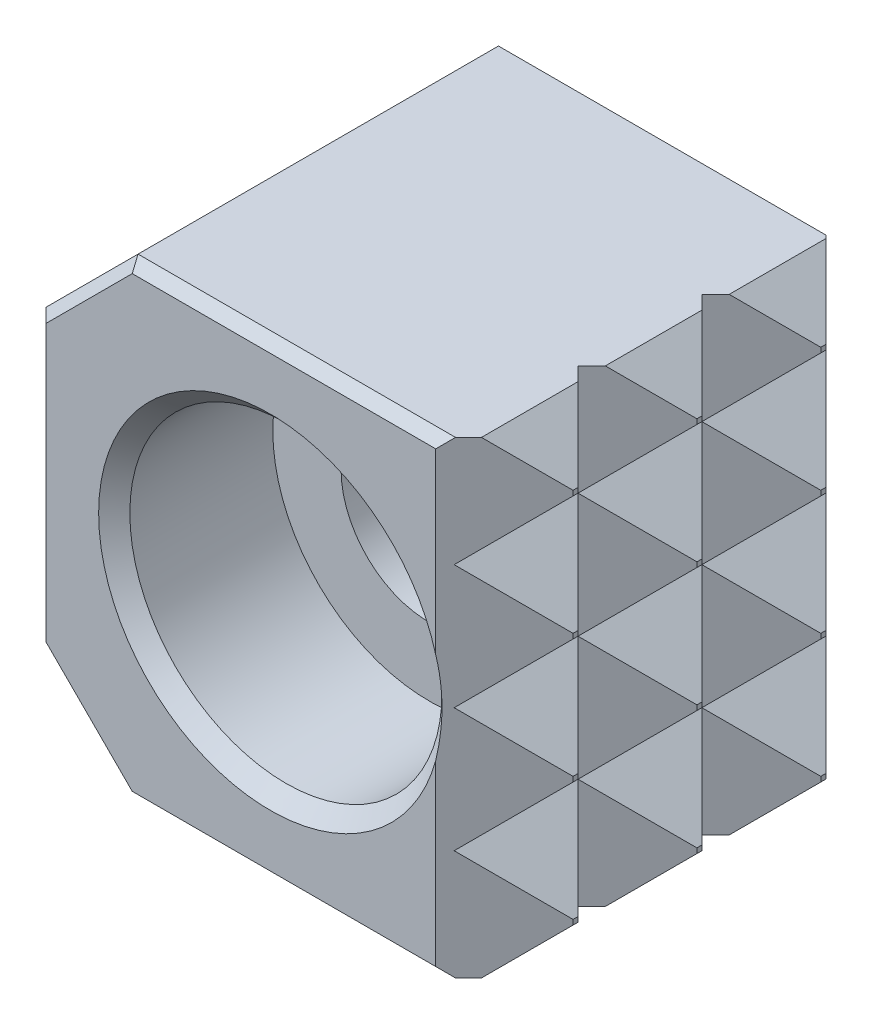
ISO-10303-21;
HEADER;
FILE_DESCRIPTION(('STEP AP214'),'2;1');
FILE_NAME('part.step','',(''),(''),'','','');
FILE_SCHEMA(('AUTOMOTIVE_DESIGN { 1 0 10303 214 1 1 1 1 }'));
ENDSEC;
DATA;
#1=APPLICATION_CONTEXT('core data for automotive mechanical design processes');
#2=APPLICATION_PROTOCOL_DEFINITION('international standard','automotive_design',2000,#1);
#3=PRODUCT_CONTEXT('',#1,'mechanical');
#4=PRODUCT('Part','Part','',(#3));
#5=PRODUCT_RELATED_PRODUCT_CATEGORY('part','',(#4));
#6=PRODUCT_DEFINITION_FORMATION('','',#4);
#7=PRODUCT_DEFINITION_CONTEXT('part definition',#1,'design');
#8=PRODUCT_DEFINITION('design','',#6,#7);
#9=PRODUCT_DEFINITION_SHAPE('','',#8);
#10=(LENGTH_UNIT() NAMED_UNIT(*) SI_UNIT(.MILLI.,.METRE.));
#11=(NAMED_UNIT(*) PLANE_ANGLE_UNIT() SI_UNIT($,.RADIAN.));
#12=(NAMED_UNIT(*) SI_UNIT($,.STERADIAN.) SOLID_ANGLE_UNIT());
#13=UNCERTAINTY_MEASURE_WITH_UNIT(LENGTH_MEASURE(1.E-05),#10,'distance_accuracy_value','');
#14=(GEOMETRIC_REPRESENTATION_CONTEXT(3) GLOBAL_UNCERTAINTY_ASSIGNED_CONTEXT((#13)) GLOBAL_UNIT_ASSIGNED_CONTEXT((#10,
#11,#12)) REPRESENTATION_CONTEXT('',''));
#15=CARTESIAN_POINT('',(0.,0.,0.));
#16=DIRECTION('',(0.,0.,1.));
#17=DIRECTION('',(1.,0.,0.));
#18=AXIS2_PLACEMENT_3D('',#15,#16,#17);
#19=CARTESIAN_POINT('',(6.,-6.,10.));
#20=DIRECTION('',(-1.,0.,0.));
#21=DIRECTION('',(0.,0.,-1.));
#22=AXIS2_PLACEMENT_3D('',#19,#20,#21);
#23=PLANE('',#22);
#24=DIRECTION('',(0.,0.,-1.));
#25=VECTOR('',#24,1.);
#26=CARTESIAN_POINT('',(6.,4.69900018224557,10.));
#27=LINE('',#26,#25);
#28=CARTESIAN_POINT('',(6.,4.69900018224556,5.065));
#29=VERTEX_POINT('',#28);
#30=CARTESIAN_POINT('',(6.,4.69900018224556,4.935));
#31=VERTEX_POINT('',#30);
#32=EDGE_CURVE('E639',#29,#31,#27,.T.);
#33=ORIENTED_EDGE('',*,*,#32,.T.);
#34=DIRECTION('',(0.,1.,0.));
#35=VECTOR('',#34,1.);
#36=CARTESIAN_POINT('',(6.,-6.,4.935));
#37=LINE('',#36,#35);
#38=CARTESIAN_POINT('',(6.,4.82600018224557,4.935));
#39=VERTEX_POINT('',#38);
#40=EDGE_CURVE('E565',#31,#39,#37,.T.);
#41=ORIENTED_EDGE('',*,*,#40,.T.);
#42=DIRECTION('',(0.,0.,1.));
#43=VECTOR('',#42,1.);
#44=CARTESIAN_POINT('',(6.,4.82600018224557,10.));
#45=LINE('',#44,#43);
#46=CARTESIAN_POINT('',(6.,4.82600018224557,5.065));
#47=VERTEX_POINT('',#46);
#48=EDGE_CURVE('E649',#39,#47,#45,.T.);
#49=ORIENTED_EDGE('',*,*,#48,.T.);
#50=DIRECTION('',(0.,1.,0.));
#51=VECTOR('',#50,1.);
#52=CARTESIAN_POINT('',(6.,-6.,5.065));
#53=LINE('',#52,#51);
#54=EDGE_CURVE('E538',#29,#47,#53,.T.);
#55=ORIENTED_EDGE('',*,*,#54,.F.);
#56=EDGE_LOOP('',(#33,#41,#49,#55));
#57=FACE_BOUND('',#56,.T.);
#58=ADVANCED_FACE('F14',(#57),#23,.F.);
#59=DIRECTION('',(0.,-1.,0.));
#60=VECTOR('',#59,1.);
#61=CARTESIAN_POINT('',(6.,-6.,8.11));
#62=LINE('',#61,#60);
#63=CARTESIAN_POINT('',(6.,4.82600018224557,8.11));
#64=VERTEX_POINT('',#63);
#65=CARTESIAN_POINT('',(6.,4.69900018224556,8.11));
#66=VERTEX_POINT('',#65);
#67=EDGE_CURVE('E512',#64,#66,#62,.T.);
#68=ORIENTED_EDGE('',*,*,#67,.F.);
#69=CARTESIAN_POINT('',(6.,4.82600018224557,8.24));
#70=VERTEX_POINT('',#69);
#71=EDGE_CURVE('E646',#64,#70,#45,.T.);
#72=ORIENTED_EDGE('',*,*,#71,.T.);
#73=DIRECTION('',(0.,1.,0.));
#74=VECTOR('',#73,1.);
#75=CARTESIAN_POINT('',(6.,-6.,8.24));
#76=LINE('',#75,#74);
#77=CARTESIAN_POINT('',(6.,4.69900018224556,8.24));
#78=VERTEX_POINT('',#77);
#79=EDGE_CURVE('E483',#78,#70,#76,.T.);
#80=ORIENTED_EDGE('',*,*,#79,.F.);
#81=EDGE_CURVE('E640',#78,#66,#27,.T.);
#82=ORIENTED_EDGE('',*,*,#81,.T.);
#83=EDGE_LOOP('',(#68,#72,#80,#82));
#84=FACE_BOUND('',#83,.T.);
#85=ADVANCED_FACE('F836',(#84),#23,.F.);
#86=DIRECTION('',(0.,0.,1.));
#87=VECTOR('',#86,1.);
#88=CARTESIAN_POINT('',(6.,-1.65100018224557,10.));
#89=LINE('',#88,#87);
#90=CARTESIAN_POINT('',(6.,-1.65100018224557,4.935));
#91=VERTEX_POINT('',#90);
#92=CARTESIAN_POINT('',(6.,-1.65100018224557,5.065));
#93=VERTEX_POINT('',#92);
#94=EDGE_CURVE('E619',#91,#93,#89,.T.);
#95=ORIENTED_EDGE('',*,*,#94,.F.);
#96=DIRECTION('',(0.,1.,0.));
#97=VECTOR('',#96,1.);
#98=CARTESIAN_POINT('',(6.,-6.,4.935));
#99=LINE('',#98,#97);
#100=CARTESIAN_POINT('',(6.,-1.52400018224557,4.935));
#101=VERTEX_POINT('',#100);
#102=EDGE_CURVE('E582',#91,#101,#99,.T.);
#103=ORIENTED_EDGE('',*,*,#102,.T.);
#104=DIRECTION('',(0.,0.,-1.));
#105=VECTOR('',#104,1.);
#106=CARTESIAN_POINT('',(6.,-1.52400018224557,10.));
#107=LINE('',#106,#105);
#108=CARTESIAN_POINT('',(6.,-1.52400018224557,5.065));
#109=VERTEX_POINT('',#108);
#110=EDGE_CURVE('E624',#109,#101,#107,.T.);
#111=ORIENTED_EDGE('',*,*,#110,.F.);
#112=DIRECTION('',(0.,1.,0.));
#113=VECTOR('',#112,1.);
#114=CARTESIAN_POINT('',(6.,-6.,5.065));
#115=LINE('',#114,#113);
#116=EDGE_CURVE('E552',#93,#109,#115,.T.);
#117=ORIENTED_EDGE('',*,*,#116,.F.);
#118=EDGE_LOOP('',(#95,#103,#111,#117));
#119=FACE_BOUND('',#118,.T.);
#120=ADVANCED_FACE('F843',(#119),#23,.F.);
#121=DIRECTION('',(0.,-1.,0.));
#122=VECTOR('',#121,1.);
#123=CARTESIAN_POINT('',(6.,-6.,8.11));
#124=LINE('',#123,#122);
#125=CARTESIAN_POINT('',(6.,-1.52400018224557,8.11));
#126=VERTEX_POINT('',#125);
#127=CARTESIAN_POINT('',(6.,-1.65100018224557,8.11));
#128=VERTEX_POINT('',#127);
#129=EDGE_CURVE('E525',#126,#128,#124,.T.);
#130=ORIENTED_EDGE('',*,*,#129,.F.);
#131=CARTESIAN_POINT('',(6.,-1.52400018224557,8.24));
#132=VERTEX_POINT('',#131);
#133=EDGE_CURVE('E625',#132,#126,#107,.T.);
#134=ORIENTED_EDGE('',*,*,#133,.F.);
#135=DIRECTION('',(0.,1.,0.));
#136=VECTOR('',#135,1.);
#137=CARTESIAN_POINT('',(6.,-6.,8.24));
#138=LINE('',#137,#136);
#139=CARTESIAN_POINT('',(6.,-1.65100018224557,8.24));
#140=VERTEX_POINT('',#139);
#141=EDGE_CURVE('E496',#140,#132,#138,.T.);
#142=ORIENTED_EDGE('',*,*,#141,.F.);
#143=EDGE_CURVE('E616',#128,#140,#89,.T.);
#144=ORIENTED_EDGE('',*,*,#143,.F.);
#145=EDGE_LOOP('',(#130,#134,#142,#144));
#146=FACE_BOUND('',#145,.T.);
#147=ADVANCED_FACE('F988',(#146),#23,.F.);
#148=DIRECTION('',(0.,0.,-1.));
#149=VECTOR('',#148,1.);
#150=CARTESIAN_POINT('',(6.,1.52400018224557,10.));
#151=LINE('',#150,#149);
#152=CARTESIAN_POINT('',(6.,1.52400018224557,5.065));
#153=VERTEX_POINT('',#152);
#154=CARTESIAN_POINT('',(6.,1.52400018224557,4.935));
#155=VERTEX_POINT('',#154);
#156=EDGE_CURVE('E629',#153,#155,#151,.T.);
#157=ORIENTED_EDGE('',*,*,#156,.T.);
#158=DIRECTION('',(0.,1.,0.));
#159=VECTOR('',#158,1.);
#160=CARTESIAN_POINT('',(6.,-6.,4.935));
#161=LINE('',#160,#159);
#162=CARTESIAN_POINT('',(6.,1.65100018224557,4.935));
#163=VERTEX_POINT('',#162);
#164=EDGE_CURVE('E574',#155,#163,#161,.T.);
#165=ORIENTED_EDGE('',*,*,#164,.T.);
#166=DIRECTION('',(0.,0.,1.));
#167=VECTOR('',#166,1.);
#168=CARTESIAN_POINT('',(6.,1.65100018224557,10.));
#169=LINE('',#168,#167);
#170=CARTESIAN_POINT('',(6.,1.65100018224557,5.065));
#171=VERTEX_POINT('',#170);
#172=EDGE_CURVE('E634',#163,#171,#169,.T.);
#173=ORIENTED_EDGE('',*,*,#172,.T.);
#174=DIRECTION('',(0.,1.,0.));
#175=VECTOR('',#174,1.);
#176=CARTESIAN_POINT('',(6.,-6.,5.065));
#177=LINE('',#176,#175);
#178=EDGE_CURVE('E545',#153,#171,#177,.T.);
#179=ORIENTED_EDGE('',*,*,#178,.F.);
#180=EDGE_LOOP('',(#157,#165,#173,#179));
#181=FACE_BOUND('',#180,.T.);
#182=ADVANCED_FACE('F1025',(#181),#23,.F.);
#183=DIRECTION('',(0.,-1.,0.));
#184=VECTOR('',#183,1.);
#185=CARTESIAN_POINT('',(6.,-6.,8.11));
#186=LINE('',#185,#184);
#187=CARTESIAN_POINT('',(6.,1.65100018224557,8.11));
#188=VERTEX_POINT('',#187);
#189=CARTESIAN_POINT('',(6.,1.52400018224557,8.11));
#190=VERTEX_POINT('',#189);
#191=EDGE_CURVE('E518',#188,#190,#186,.T.);
#192=ORIENTED_EDGE('',*,*,#191,.F.);
#193=CARTESIAN_POINT('',(6.,1.65100018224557,8.24));
#194=VERTEX_POINT('',#193);
#195=EDGE_CURVE('E631',#188,#194,#169,.T.);
#196=ORIENTED_EDGE('',*,*,#195,.T.);
#197=DIRECTION('',(0.,1.,0.));
#198=VECTOR('',#197,1.);
#199=CARTESIAN_POINT('',(6.,-6.,8.24));
#200=LINE('',#199,#198);
#201=CARTESIAN_POINT('',(6.,1.52400018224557,8.24));
#202=VERTEX_POINT('',#201);
#203=EDGE_CURVE('E489',#202,#194,#200,.T.);
#204=ORIENTED_EDGE('',*,*,#203,.F.);
#205=EDGE_CURVE('E630',#202,#190,#151,.T.);
#206=ORIENTED_EDGE('',*,*,#205,.T.);
#207=EDGE_LOOP('',(#192,#196,#204,#206));
#208=FACE_BOUND('',#207,.T.);
#209=ADVANCED_FACE('F1007',(#208),#23,.F.);
#210=DIRECTION('',(0.,0.,1.));
#211=VECTOR('',#210,1.);
#212=CARTESIAN_POINT('',(6.,-4.82600018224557,10.));
#213=LINE('',#212,#211);
#214=CARTESIAN_POINT('',(6.,-4.82600018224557,4.935));
#215=VERTEX_POINT('',#214);
#216=CARTESIAN_POINT('',(6.,-4.82600018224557,5.065));
#217=VERTEX_POINT('',#216);
#218=EDGE_CURVE('E609',#215,#217,#213,.T.);
#219=ORIENTED_EDGE('',*,*,#218,.F.);
#220=DIRECTION('',(0.,1.,0.));
#221=VECTOR('',#220,1.);
#222=CARTESIAN_POINT('',(6.,-6.,4.935));
#223=LINE('',#222,#221);
#224=CARTESIAN_POINT('',(6.,-4.69900018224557,4.935));
#225=VERTEX_POINT('',#224);
#226=EDGE_CURVE('E589',#215,#225,#223,.T.);
#227=ORIENTED_EDGE('',*,*,#226,.T.);
#228=DIRECTION('',(0.,0.,-1.));
#229=VECTOR('',#228,1.);
#230=CARTESIAN_POINT('',(6.,-4.69900018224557,10.));
#231=LINE('',#230,#229);
#232=CARTESIAN_POINT('',(6.,-4.69900018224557,5.065));
#233=VERTEX_POINT('',#232);
#234=EDGE_CURVE('E614',#233,#225,#231,.T.);
#235=ORIENTED_EDGE('',*,*,#234,.F.);
#236=DIRECTION('',(0.,1.,0.));
#237=VECTOR('',#236,1.);
#238=CARTESIAN_POINT('',(6.,-6.,5.065));
#239=LINE('',#238,#237);
#240=EDGE_CURVE('E560',#217,#233,#239,.T.);
#241=ORIENTED_EDGE('',*,*,#240,.F.);
#242=EDGE_LOOP('',(#219,#227,#235,#241));
#243=FACE_BOUND('',#242,.T.);
#244=ADVANCED_FACE('F803',(#243),#23,.F.);
#245=DIRECTION('',(0.,-1.,0.));
#246=VECTOR('',#245,1.);
#247=CARTESIAN_POINT('',(6.,-6.,8.11));
#248=LINE('',#247,#246);
#249=CARTESIAN_POINT('',(6.,-4.69900018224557,8.11));
#250=VERTEX_POINT('',#249);
#251=CARTESIAN_POINT('',(6.,-4.82600018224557,8.11));
#252=VERTEX_POINT('',#251);
#253=EDGE_CURVE('E533',#250,#252,#248,.T.);
#254=ORIENTED_EDGE('',*,*,#253,.F.);
#255=CARTESIAN_POINT('',(6.,-4.69900018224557,8.24));
#256=VERTEX_POINT('',#255);
#257=EDGE_CURVE('E615',#256,#250,#231,.T.);
#258=ORIENTED_EDGE('',*,*,#257,.F.);
#259=DIRECTION('',(0.,1.,0.));
#260=VECTOR('',#259,1.);
#261=CARTESIAN_POINT('',(6.,-6.,8.24));
#262=LINE('',#261,#260);
#263=CARTESIAN_POINT('',(6.,-4.82600018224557,8.24));
#264=VERTEX_POINT('',#263);
#265=EDGE_CURVE('E504',#264,#256,#262,.T.);
#266=ORIENTED_EDGE('',*,*,#265,.F.);
#267=EDGE_CURVE('E606',#252,#264,#213,.T.);
#268=ORIENTED_EDGE('',*,*,#267,.F.);
#269=EDGE_LOOP('',(#254,#258,#266,#268));
#270=FACE_BOUND('',#269,.T.);
#271=ADVANCED_FACE('F793',(#270),#23,.F.);
#272=CARTESIAN_POINT('',(6.,-6.,10.));
#273=DIRECTION('',(0.,-1.,0.));
#274=DIRECTION('',(1.,0.,0.));
#275=AXIS2_PLACEMENT_3D('',#272,#273,#274);
#276=PLANE('',#275);
#277=DIRECTION('',(-0.707106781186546,0.,0.707106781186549));
#278=VECTOR('',#277,1.);
#279=CARTESIAN_POINT('',(6.065,-6.,8.175));
#280=LINE('',#279,#278);
#281=CARTESIAN_POINT('',(4.82600004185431,-6.,9.4139999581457));
#282=VERTEX_POINT('',#281);
#283=CARTESIAN_POINT('',(4.494,-6.,9.746));
#284=VERTEX_POINT('',#283);
#285=EDGE_CURVE('E390',#282,#284,#280,.T.);
#286=ORIENTED_EDGE('',*,*,#285,.T.);
#287=DIRECTION('',(-1.,0.,0.));
#288=VECTOR('',#287,1.);
#289=CARTESIAN_POINT('',(-3.64415,-6.,9.746));
#290=LINE('',#289,#288);
#291=CARTESIAN_POINT('',(-3.64415,-6.,9.746));
#292=VERTEX_POINT('',#291);
#293=EDGE_CURVE('E709',#284,#292,#290,.T.);
#294=ORIENTED_EDGE('',*,*,#293,.T.);
#295=DIRECTION('',(0.,0.,-1.));
#296=VECTOR('',#295,1.);
#297=CARTESIAN_POINT('',(-3.64415,-6.,0.));
#298=LINE('',#297,#296);
#299=CARTESIAN_POINT('',(-3.64415,-6.,0.508));
#300=VERTEX_POINT('',#299);
#301=EDGE_CURVE('E672',#292,#300,#298,.T.);
#302=ORIENTED_EDGE('',*,*,#301,.T.);
#303=DIRECTION('',(1.,0.,0.));
#304=VECTOR('',#303,1.);
#305=CARTESIAN_POINT('',(6.,-6.,0.508));
#306=LINE('',#305,#304);
#307=CARTESIAN_POINT('',(4.748,-6.,0.508));
#308=VERTEX_POINT('',#307);
#309=EDGE_CURVE('E693',#300,#308,#306,.T.);
#310=ORIENTED_EDGE('',*,*,#309,.T.);
#311=DIRECTION('',(-0.707106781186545,0.,-0.70710678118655));
#312=VECTOR('',#311,1.);
#313=CARTESIAN_POINT('',(6.065,-6.,1.825));
#314=LINE('',#313,#312);
#315=CARTESIAN_POINT('',(4.82600004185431,-6.,0.586000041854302));
#316=VERTEX_POINT('',#315);
#317=EDGE_CURVE('E387',#316,#308,#314,.T.);
#318=ORIENTED_EDGE('',*,*,#317,.F.);
#319=DIRECTION('',(0.,0.,1.));
#320=VECTOR('',#319,1.);
#321=CARTESIAN_POINT('',(4.82600004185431,-6.,10.));
#322=LINE('',#321,#320);
#323=CARTESIAN_POINT('',(4.82600004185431,-6.,3.06399995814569));
#324=VERTEX_POINT('',#323);
#325=EDGE_CURVE('E386',#316,#324,#322,.T.);
#326=ORIENTED_EDGE('',*,*,#325,.T.);
#327=DIRECTION('',(0.70710678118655,0.,-0.707106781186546));
#328=VECTOR('',#327,1.);
#329=CARTESIAN_POINT('',(4.4775,-6.,3.4125));
#330=LINE('',#329,#328);
#331=CARTESIAN_POINT('',(4.4775,-6.,3.4125));
#332=VERTEX_POINT('',#331);
#333=EDGE_CURVE('E369',#332,#324,#330,.T.);
#334=ORIENTED_EDGE('',*,*,#333,.F.);
#335=DIRECTION('',(-0.707106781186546,0.,-0.707106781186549));
#336=VECTOR('',#335,1.);
#337=CARTESIAN_POINT('',(6.065,-6.,5.));
#338=LINE('',#337,#336);
#339=CARTESIAN_POINT('',(4.82600004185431,-6.,3.7610000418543));
#340=VERTEX_POINT('',#339);
#341=EDGE_CURVE('E358',#340,#332,#338,.T.);
#342=ORIENTED_EDGE('',*,*,#341,.F.);
#343=CARTESIAN_POINT('',(4.82600004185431,-6.,6.2389999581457));
#344=VERTEX_POINT('',#343);
#345=EDGE_CURVE('E605',#340,#344,#322,.T.);
#346=ORIENTED_EDGE('',*,*,#345,.T.);
#347=DIRECTION('',(-0.707106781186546,0.,0.707106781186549));
#348=VECTOR('',#347,1.);
#349=CARTESIAN_POINT('',(6.065,-6.,5.));
#350=LINE('',#349,#348);
#351=CARTESIAN_POINT('',(4.4775,-6.,6.5875));
#352=VERTEX_POINT('',#351);
#353=EDGE_CURVE('E398',#344,#352,#350,.T.);
#354=ORIENTED_EDGE('',*,*,#353,.T.);
#355=DIRECTION('',(0.707106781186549,0.,0.707106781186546));
#356=VECTOR('',#355,1.);
#357=CARTESIAN_POINT('',(4.4775,-6.,6.5875));
#358=LINE('',#357,#356);
#359=CARTESIAN_POINT('',(4.82600004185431,-6.,6.93600004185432));
#360=VERTEX_POINT('',#359);
#361=EDGE_CURVE('E395',#352,#360,#358,.T.);
#362=ORIENTED_EDGE('',*,*,#361,.T.);
#363=EDGE_CURVE('E597',#360,#282,#322,.T.);
#364=ORIENTED_EDGE('',*,*,#363,.T.);
#365=EDGE_LOOP('',(#286,#294,#302,#310,#318,#326,#334,#342,#346,#354,#362,#364));
#366=FACE_BOUND('',#365,.T.);
#367=ADVANCED_FACE('F383',(#366),#276,.T.);
#368=CARTESIAN_POINT('',(6.,6.,10.));
#369=DIRECTION('',(0.,0.,-1.));
#370=DIRECTION('',(1.,0.,0.));
#371=AXIS2_PLACEMENT_3D('',#368,#369,#370);
#372=PLANE('',#371);
#373=DIRECTION('',(0.,-1.,0.));
#374=VECTOR('',#373,1.);
#375=CARTESIAN_POINT('',(4.24,6.,10.));
#376=LINE('',#375,#374);
#377=CARTESIAN_POINT('',(4.24,-1.17575507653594,10.));
#378=VERTEX_POINT('',#377);
#379=CARTESIAN_POINT('',(4.24,-5.746,10.));
#380=VERTEX_POINT('',#379);
#381=EDGE_CURVE('E509',#378,#380,#376,.T.);
#382=ORIENTED_EDGE('',*,*,#381,.F.);
#383=CARTESIAN_POINT('',(0.,0.,10.));
#384=DIRECTION('',(0.,0.,-1.));
#385=DIRECTION('',(-1.,0.,0.));
#386=AXIS2_PLACEMENT_3D('',#383,#384,#385);
#387=CIRCLE('',#386,4.4);
#388=CARTESIAN_POINT('',(4.24,1.17575507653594,10.));
#389=VERTEX_POINT('',#388);
#390=EDGE_CURVE('E28',#378,#389,#387,.T.);
#391=ORIENTED_EDGE('',*,*,#390,.T.);
#392=CARTESIAN_POINT('',(4.24,5.746,10.));
#393=VERTEX_POINT('',#392);
#394=EDGE_CURVE('E510',#393,#389,#376,.T.);
#395=ORIENTED_EDGE('',*,*,#394,.F.);
#396=DIRECTION('',(-1.,0.,0.));
#397=VECTOR('',#396,1.);
#398=CARTESIAN_POINT('',(-3.64415,5.746,10.));
#399=LINE('',#398,#397);
#400=CARTESIAN_POINT('',(-3.53893975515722,5.746,10.));
#401=VERTEX_POINT('',#400);
#402=EDGE_CURVE('E712',#393,#401,#399,.T.);
#403=ORIENTED_EDGE('',*,*,#402,.T.);
#404=DIRECTION('',(-0.707106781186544,-0.707106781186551,0.));
#405=VECTOR('',#404,1.);
#406=CARTESIAN_POINT('',(-5.82039487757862,3.46454487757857,10.));
#407=LINE('',#406,#405);
#408=CARTESIAN_POINT('',(-5.746,3.5389397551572,10.));
#409=VERTEX_POINT('',#408);
#410=EDGE_CURVE('E714',#401,#409,#407,.T.);
#411=ORIENTED_EDGE('',*,*,#410,.T.);
#412=DIRECTION('',(0.,-1.,0.));
#413=VECTOR('',#412,1.);
#414=CARTESIAN_POINT('',(-5.746,6.,10.));
#415=LINE('',#414,#413);
#416=CARTESIAN_POINT('',(-5.746,-3.5389397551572,10.));
#417=VERTEX_POINT('',#416);
#418=EDGE_CURVE('E716',#409,#417,#415,.T.);
#419=ORIENTED_EDGE('',*,*,#418,.T.);
#420=DIRECTION('',(0.707106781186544,-0.707106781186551,0.));
#421=VECTOR('',#420,1.);
#422=CARTESIAN_POINT('',(-3.4645448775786,-5.82039487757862,10.));
#423=LINE('',#422,#421);
#424=CARTESIAN_POINT('',(-3.53893975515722,-5.746,10.));
#425=VERTEX_POINT('',#424);
#426=EDGE_CURVE('E718',#417,#425,#423,.T.);
#427=ORIENTED_EDGE('',*,*,#426,.T.);
#428=DIRECTION('',(1.,0.,0.));
#429=VECTOR('',#428,1.);
#430=CARTESIAN_POINT('',(4.24,-5.746,10.));
#431=LINE('',#430,#429);
#432=EDGE_CURVE('E720',#425,#380,#431,.T.);
#433=ORIENTED_EDGE('',*,*,#432,.T.);
#434=EDGE_LOOP('',(#382,#391,#395,#403,#411,#419,#427,#433));
#435=FACE_BOUND('',#434,.T.);
#436=ADVANCED_FACE('F745',(#435),#372,.F.);
#437=CARTESIAN_POINT('',(-6.,6.,10.));
#438=DIRECTION('',(0.,1.,0.));
#439=DIRECTION('',(-1.,0.,0.));
#440=AXIS2_PLACEMENT_3D('',#437,#438,#439);
#441=PLANE('',#440);
#442=DIRECTION('',(0.,0.,1.));
#443=VECTOR('',#442,1.);
#444=CARTESIAN_POINT('',(-3.64415,6.,10.));
#445=LINE('',#444,#443);
#446=CARTESIAN_POINT('',(-3.64415,6.,0.508));
#447=VERTEX_POINT('',#446);
#448=CARTESIAN_POINT('',(-3.64415,6.,9.746));
#449=VERTEX_POINT('',#448);
#450=EDGE_CURVE('E679',#447,#449,#445,.T.);
#451=ORIENTED_EDGE('',*,*,#450,.T.);
#452=DIRECTION('',(1.,0.,0.));
#453=VECTOR('',#452,1.);
#454=CARTESIAN_POINT('',(4.24,6.,9.746));
#455=LINE('',#454,#453);
#456=CARTESIAN_POINT('',(4.494,6.,9.746));
#457=VERTEX_POINT('',#456);
#458=EDGE_CURVE('E733',#449,#457,#455,.T.);
#459=ORIENTED_EDGE('',*,*,#458,.T.);
#460=DIRECTION('',(-0.707106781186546,0.,0.707106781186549));
#461=VECTOR('',#460,1.);
#462=CARTESIAN_POINT('',(6.065,6.,8.175));
#463=LINE('',#462,#461);
#464=CARTESIAN_POINT('',(4.82600004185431,6.,9.4139999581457));
#465=VERTEX_POINT('',#464);
#466=EDGE_CURVE('E410',#465,#457,#463,.T.);
#467=ORIENTED_EDGE('',*,*,#466,.F.);
#468=DIRECTION('',(0.,0.,1.));
#469=VECTOR('',#468,1.);
#470=CARTESIAN_POINT('',(4.82600004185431,6.,10.));
#471=LINE('',#470,#469);
#472=CARTESIAN_POINT('',(4.82600004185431,6.,6.93600004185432));
#473=VERTEX_POINT('',#472);
#474=EDGE_CURVE('E641',#473,#465,#471,.T.);
#475=ORIENTED_EDGE('',*,*,#474,.F.);
#476=DIRECTION('',(0.707106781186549,0.,0.707106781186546));
#477=VECTOR('',#476,1.);
#478=CARTESIAN_POINT('',(4.4775,6.,6.5875));
#479=LINE('',#478,#477);
#480=CARTESIAN_POINT('',(4.4775,6.,6.5875));
#481=VERTEX_POINT('',#480);
#482=EDGE_CURVE('E413',#481,#473,#479,.T.);
#483=ORIENTED_EDGE('',*,*,#482,.F.);
#484=DIRECTION('',(-0.707106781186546,0.,0.707106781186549));
#485=VECTOR('',#484,1.);
#486=CARTESIAN_POINT('',(6.065,6.,5.));
#487=LINE('',#486,#485);
#488=CARTESIAN_POINT('',(4.82600004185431,6.,6.2389999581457));
#489=VERTEX_POINT('',#488);
#490=EDGE_CURVE('E378',#489,#481,#487,.T.);
#491=ORIENTED_EDGE('',*,*,#490,.F.);
#492=CARTESIAN_POINT('',(4.82600004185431,6.,3.7610000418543));
#493=VERTEX_POINT('',#492);
#494=EDGE_CURVE('E644',#493,#489,#471,.T.);
#495=ORIENTED_EDGE('',*,*,#494,.F.);
#496=DIRECTION('',(-0.707106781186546,0.,-0.707106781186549));
#497=VECTOR('',#496,1.);
#498=CARTESIAN_POINT('',(6.065,6.,5.));
#499=LINE('',#498,#497);
#500=CARTESIAN_POINT('',(4.4775,6.,3.4125));
#501=VERTEX_POINT('',#500);
#502=EDGE_CURVE('E401',#493,#501,#499,.T.);
#503=ORIENTED_EDGE('',*,*,#502,.T.);
#504=DIRECTION('',(0.70710678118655,0.,-0.707106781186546));
#505=VECTOR('',#504,1.);
#506=CARTESIAN_POINT('',(4.4775,6.,3.4125));
#507=LINE('',#506,#505);
#508=CARTESIAN_POINT('',(4.82600004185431,6.,3.06399995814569));
#509=VERTEX_POINT('',#508);
#510=EDGE_CURVE('E404',#501,#509,#507,.T.);
#511=ORIENTED_EDGE('',*,*,#510,.T.);
#512=CARTESIAN_POINT('',(4.82600004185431,6.,0.586000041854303));
#513=VERTEX_POINT('',#512);
#514=EDGE_CURVE('E645',#513,#509,#471,.T.);
#515=ORIENTED_EDGE('',*,*,#514,.F.);
#516=DIRECTION('',(-0.707106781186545,0.,-0.70710678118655));
#517=VECTOR('',#516,1.);
#518=CARTESIAN_POINT('',(6.065,6.,1.825));
#519=LINE('',#518,#517);
#520=CARTESIAN_POINT('',(4.748,6.,0.508));
#521=VERTEX_POINT('',#520);
#522=EDGE_CURVE('E407',#513,#521,#519,.T.);
#523=ORIENTED_EDGE('',*,*,#522,.T.);
#524=DIRECTION('',(-1.,0.,0.));
#525=VECTOR('',#524,1.);
#526=CARTESIAN_POINT('',(-6.,6.,0.508));
#527=LINE('',#526,#525);
#528=EDGE_CURVE('E707',#521,#447,#527,.T.);
#529=ORIENTED_EDGE('',*,*,#528,.T.);
#530=EDGE_LOOP('',(#451,#459,#467,#475,#483,#491,#495,#503,#511,#515,#523,#529));
#531=FACE_BOUND('',#530,.T.);
#532=ADVANCED_FACE('F916',(#531),#441,.T.);
#533=CARTESIAN_POINT('',(6.0635,-4.76250018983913,10.));
#534=DIRECTION('',(0.707106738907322,-0.707106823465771,0.));
#535=DIRECTION('',(0.707106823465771,0.707106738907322,0.));
#536=AXIS2_PLACEMENT_3D('',#533,#534,#535);
#537=PLANE('',#536);
#538=DIRECTION('',(-0.577350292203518,-0.577350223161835,-0.577350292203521));
#539=VECTOR('',#538,1.);
#540=CARTESIAN_POINT('',(7.73066679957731,-3.0953335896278,6.66566679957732));
#541=LINE('',#540,#539);
#542=EDGE_CURVE('E364',#215,#340,#541,.T.);
#543=ORIENTED_EDGE('',*,*,#542,.F.);
#544=ORIENTED_EDGE('',*,*,#218,.T.);
#545=DIRECTION('',(-0.577350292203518,-0.577350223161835,0.577350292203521));
#546=VECTOR('',#545,1.);
#547=CARTESIAN_POINT('',(4.39733320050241,-6.42866679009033,6.66766679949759));
#548=LINE('',#547,#546);
#549=EDGE_CURVE('E562',#217,#344,#548,.T.);
#550=ORIENTED_EDGE('',*,*,#549,.T.);
#551=ORIENTED_EDGE('',*,*,#345,.F.);
#552=EDGE_LOOP('',(#543,#544,#550,#551));
#553=FACE_BOUND('',#552,.T.);
#554=ADVANCED_FACE('F806',(#553),#537,.T.);
#555=ORIENTED_EDGE('',*,*,#363,.F.);
#556=DIRECTION('',(0.57735029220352,0.577350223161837,0.577350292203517));
#557=VECTOR('',#556,1.);
#558=CARTESIAN_POINT('',(6.67233338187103,-4.15366688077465,8.78233338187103));
#559=LINE('',#558,#557);
#560=EDGE_CURVE('E535',#360,#252,#559,.T.);
#561=ORIENTED_EDGE('',*,*,#560,.T.);
#562=ORIENTED_EDGE('',*,*,#267,.T.);
#563=DIRECTION('',(-0.577350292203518,-0.577350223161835,0.577350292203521));
#564=VECTOR('',#563,1.);
#565=CARTESIAN_POINT('',(5.45566661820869,-5.37033349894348,8.78433338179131));
#566=LINE('',#565,#564);
#567=EDGE_CURVE('E506',#264,#282,#566,.T.);
#568=ORIENTED_EDGE('',*,*,#567,.T.);
#569=EDGE_LOOP('',(#555,#561,#562,#568));
#570=FACE_BOUND('',#569,.T.);
#571=ADVANCED_FACE('F787',(#570),#537,.T.);
#572=CARTESIAN_POINT('',(4.476,-3.175,10.));
#573=DIRECTION('',(0.707106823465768,0.707106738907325,0.));
#574=DIRECTION('',(-0.707106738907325,0.707106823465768,0.));
#575=AXIS2_PLACEMENT_3D('',#572,#573,#574);
#576=PLANE('',#575);
#577=DIRECTION('',(-0.577350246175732,0.577350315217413,-0.577350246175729));
#578=VECTOR('',#577,1.);
#579=CARTESIAN_POINT('',(5.61399990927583,-4.31300004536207,7.72399990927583));
#580=LINE('',#579,#578);
#581=CARTESIAN_POINT('',(4.4775,-3.17650000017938,6.5875));
#582=VERTEX_POINT('',#581);
#583=EDGE_CURVE('E530',#250,#582,#580,.T.);
#584=ORIENTED_EDGE('',*,*,#583,.T.);
#585=DIRECTION('',(0.57735024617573,-0.577350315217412,-0.577350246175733));
#586=VECTOR('',#585,1.);
#587=CARTESIAN_POINT('',(3.33900009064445,-2.03799995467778,7.72599990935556));
#588=LINE('',#587,#586);
#589=EDGE_CURVE('E557',#582,#233,#588,.T.);
#590=ORIENTED_EDGE('',*,*,#589,.T.);
#591=ORIENTED_EDGE('',*,*,#234,.T.);
#592=DIRECTION('',(0.57735024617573,-0.577350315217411,0.577350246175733));
#593=VECTOR('',#592,1.);
#594=CARTESIAN_POINT('',(6.67233315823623,-5.37133342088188,5.60733315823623));
#595=LINE('',#594,#593);
#596=CARTESIAN_POINT('',(4.4775,-3.17650000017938,3.4125));
#597=VERTEX_POINT('',#596);
#598=EDGE_CURVE('E587',#597,#225,#595,.T.);
#599=ORIENTED_EDGE('',*,*,#598,.F.);
#600=DIRECTION('',(-0.577350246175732,0.577350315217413,0.577350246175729));
#601=VECTOR('',#600,1.);
#602=CARTESIAN_POINT('',(2.28066684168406,-0.979666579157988,5.60933315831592));
#603=LINE('',#602,#601);
#604=CARTESIAN_POINT('',(6.,-4.69900018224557,1.89));
#605=VERTEX_POINT('',#604);
#606=EDGE_CURVE('E376',#605,#597,#603,.T.);
#607=ORIENTED_EDGE('',*,*,#606,.F.);
#608=CARTESIAN_POINT('',(6.,-4.69900018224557,1.76));
#609=VERTEX_POINT('',#608);
#610=EDGE_CURVE('E611',#605,#609,#231,.T.);
#611=ORIENTED_EDGE('',*,*,#610,.T.);
#612=DIRECTION('',(0.57735024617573,-0.577350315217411,0.577350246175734));
#613=VECTOR('',#612,1.);
#614=CARTESIAN_POINT('',(7.73066640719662,-6.42966679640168,3.49066640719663));
#615=LINE('',#614,#613);
#616=CARTESIAN_POINT('',(4.476,-3.175,0.23599999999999));
#617=VERTEX_POINT('',#616);
#618=EDGE_CURVE('E473',#617,#609,#615,.T.);
#619=ORIENTED_EDGE('',*,*,#618,.F.);
#620=DIRECTION('',(0.,0.,-1.));
#621=VECTOR('',#620,1.);
#622=CARTESIAN_POINT('',(4.476,-3.175,10.));
#623=LINE('',#622,#621);
#624=CARTESIAN_POINT('',(4.476,-3.175,9.764));
#625=VERTEX_POINT('',#624);
#626=EDGE_CURVE('E593',#625,#617,#623,.T.);
#627=ORIENTED_EDGE('',*,*,#626,.F.);
#628=DIRECTION('',(0.57735024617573,-0.577350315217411,-0.577350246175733));
#629=VECTOR('',#628,1.);
#630=CARTESIAN_POINT('',(4.39733333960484,-3.09633333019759,9.84266666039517));
#631=LINE('',#630,#629);
#632=EDGE_CURVE('E501',#625,#256,#631,.T.);
#633=ORIENTED_EDGE('',*,*,#632,.T.);
#634=ORIENTED_EDGE('',*,*,#257,.T.);
#635=EDGE_LOOP('',(#584,#590,#591,#599,#607,#611,#619,#627,#633,#634));
#636=FACE_BOUND('',#635,.T.);
#637=ADVANCED_FACE('F798',(#636),#576,.T.);
#638=CARTESIAN_POINT('',(6.0635,-1.58750018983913,10.));
#639=DIRECTION('',(0.70710673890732,-0.707106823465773,0.));
#640=DIRECTION('',(0.707106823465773,0.70710673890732,0.));
#641=AXIS2_PLACEMENT_3D('',#638,#639,#640);
#642=PLANE('',#641);
#643=ORIENTED_EDGE('',*,*,#94,.T.);
#644=DIRECTION('',(-0.57735029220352,-0.577350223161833,0.577350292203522));
#645=VECTOR('',#644,1.);
#646=CARTESIAN_POINT('',(4.39733320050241,-3.25366679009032,6.6676667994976));
#647=LINE('',#646,#645);
#648=CARTESIAN_POINT('',(4.4775,-3.17350000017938,6.5875));
#649=VERTEX_POINT('',#648);
#650=EDGE_CURVE('E554',#93,#649,#647,.T.);
#651=ORIENTED_EDGE('',*,*,#650,.T.);
#652=DIRECTION('',(0.577350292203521,0.577350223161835,0.577350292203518));
#653=VECTOR('',#652,1.);
#654=CARTESIAN_POINT('',(6.67233338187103,-0.978666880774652,8.78233338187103));
#655=LINE('',#654,#653);
#656=EDGE_CURVE('E527',#649,#128,#655,.T.);
#657=ORIENTED_EDGE('',*,*,#656,.T.);
#658=ORIENTED_EDGE('',*,*,#143,.T.);
#659=DIRECTION('',(-0.577350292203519,-0.577350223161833,0.577350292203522));
#660=VECTOR('',#659,1.);
#661=CARTESIAN_POINT('',(5.45566661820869,-2.19533349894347,8.78433338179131));
#662=LINE('',#661,#660);
#663=EDGE_CURVE('E498',#140,#625,#662,.T.);
#664=ORIENTED_EDGE('',*,*,#663,.T.);
#665=ORIENTED_EDGE('',*,*,#626,.T.);
#666=DIRECTION('',(-0.577350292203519,-0.577350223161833,-0.577350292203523));
#667=VECTOR('',#666,1.);
#668=CARTESIAN_POINT('',(8.7890002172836,1.13799970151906,4.54900021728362));
#669=LINE('',#668,#667);
#670=CARTESIAN_POINT('',(6.,-1.65100018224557,1.76));
#671=VERTEX_POINT('',#670);
#672=EDGE_CURVE('E471',#671,#617,#669,.T.);
#673=ORIENTED_EDGE('',*,*,#672,.F.);
#674=CARTESIAN_POINT('',(6.,-1.65100018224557,1.89));
#675=VERTEX_POINT('',#674);
#676=EDGE_CURVE('E620',#671,#675,#89,.T.);
#677=ORIENTED_EDGE('',*,*,#676,.T.);
#678=DIRECTION('',(0.577350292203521,0.577350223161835,-0.577350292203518));
#679=VECTOR('',#678,1.);
#680=CARTESIAN_POINT('',(3.33899978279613,-4.31200008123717,4.55100021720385));
#681=LINE('',#680,#679);
#682=CARTESIAN_POINT('',(4.4775,-3.17350000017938,3.4125));
#683=VERTEX_POINT('',#682);
#684=EDGE_CURVE('E443',#683,#675,#681,.T.);
#685=ORIENTED_EDGE('',*,*,#684,.F.);
#686=DIRECTION('',(-0.577350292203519,-0.577350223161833,-0.577350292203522));
#687=VECTOR('',#686,1.);
#688=CARTESIAN_POINT('',(7.73066679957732,0.0796664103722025,6.66566679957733));
#689=LINE('',#688,#687);
#690=EDGE_CURVE('E585',#91,#683,#689,.T.);
#691=ORIENTED_EDGE('',*,*,#690,.F.);
#692=EDGE_LOOP('',(#643,#651,#657,#658,#664,#665,#673,#677,#685,#691));
#693=FACE_BOUND('',#692,.T.);
#694=ADVANCED_FACE('F980',(#693),#642,.T.);
#695=CARTESIAN_POINT('',(4.476,0.,10.));
#696=DIRECTION('',(0.707106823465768,0.707106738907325,0.));
#697=DIRECTION('',(-0.707106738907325,0.707106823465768,0.));
#698=AXIS2_PLACEMENT_3D('',#695,#696,#697);
#699=PLANE('',#698);
#700=DIRECTION('',(-0.577350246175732,0.577350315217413,-0.577350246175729));
#701=VECTOR('',#700,1.);
#702=CARTESIAN_POINT('',(5.61399990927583,-1.13800004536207,7.72399990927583));
#703=LINE('',#702,#701);
#704=CARTESIAN_POINT('',(4.4775,-0.00150000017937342,6.5875));
#705=VERTEX_POINT('',#704);
#706=EDGE_CURVE('E522',#126,#705,#703,.T.);
#707=ORIENTED_EDGE('',*,*,#706,.T.);
#708=DIRECTION('',(0.577350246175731,-0.577350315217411,-0.577350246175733));
#709=VECTOR('',#708,1.);
#710=CARTESIAN_POINT('',(3.33900009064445,1.13700004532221,7.72599990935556));
#711=LINE('',#710,#709);
#712=EDGE_CURVE('E549',#705,#109,#711,.T.);
#713=ORIENTED_EDGE('',*,*,#712,.T.);
#714=ORIENTED_EDGE('',*,*,#110,.T.);
#715=DIRECTION('',(0.57735024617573,-0.577350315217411,0.577350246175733));
#716=VECTOR('',#715,1.);
#717=CARTESIAN_POINT('',(6.67233315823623,-2.19633342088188,5.60733315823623));
#718=LINE('',#717,#716);
#719=CARTESIAN_POINT('',(4.4775,-0.00150000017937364,3.4125));
#720=VERTEX_POINT('',#719);
#721=EDGE_CURVE('E580',#720,#101,#718,.T.);
#722=ORIENTED_EDGE('',*,*,#721,.F.);
#723=DIRECTION('',(-0.577350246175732,0.577350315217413,0.577350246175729));
#724=VECTOR('',#723,1.);
#725=CARTESIAN_POINT('',(2.28066684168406,2.19533342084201,5.60933315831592));
#726=LINE('',#725,#724);
#727=CARTESIAN_POINT('',(6.,-1.52400018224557,1.89));
#728=VERTEX_POINT('',#727);
#729=EDGE_CURVE('E438',#728,#720,#726,.T.);
#730=ORIENTED_EDGE('',*,*,#729,.F.);
#731=CARTESIAN_POINT('',(6.,-1.52400018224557,1.76));
#732=VERTEX_POINT('',#731);
#733=EDGE_CURVE('E621',#728,#732,#107,.T.);
#734=ORIENTED_EDGE('',*,*,#733,.T.);
#735=DIRECTION('',(0.57735024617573,-0.577350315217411,0.577350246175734));
#736=VECTOR('',#735,1.);
#737=CARTESIAN_POINT('',(7.73066640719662,-3.25466679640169,3.49066640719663));
#738=LINE('',#737,#736);
#739=CARTESIAN_POINT('',(4.476,0.,0.235999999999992));
#740=VERTEX_POINT('',#739);
#741=EDGE_CURVE('E466',#740,#732,#738,.T.);
#742=ORIENTED_EDGE('',*,*,#741,.F.);
#743=DIRECTION('',(0.,0.,-1.));
#744=VECTOR('',#743,1.);
#745=CARTESIAN_POINT('',(4.476,0.,10.));
#746=LINE('',#745,#744);
#747=CARTESIAN_POINT('',(4.476,0.,9.764));
#748=VERTEX_POINT('',#747);
#749=EDGE_CURVE('E598',#748,#740,#746,.T.);
#750=ORIENTED_EDGE('',*,*,#749,.F.);
#751=DIRECTION('',(0.57735024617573,-0.577350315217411,-0.577350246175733));
#752=VECTOR('',#751,1.);
#753=CARTESIAN_POINT('',(4.39733333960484,0.0786666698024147,9.84266666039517));
#754=LINE('',#753,#752);
#755=EDGE_CURVE('E493',#748,#132,#754,.T.);
#756=ORIENTED_EDGE('',*,*,#755,.T.);
#757=ORIENTED_EDGE('',*,*,#133,.T.);
#758=EDGE_LOOP('',(#707,#713,#714,#722,#730,#734,#742,#750,#756,#757));
#759=FACE_BOUND('',#758,.T.);
#760=ADVANCED_FACE('F970',(#759),#699,.T.);
#761=CARTESIAN_POINT('',(4.476,0.,10.));
#762=DIRECTION('',(-0.707106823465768,0.707106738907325,0.));
#763=DIRECTION('',(-0.707106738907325,-0.707106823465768,0.));
#764=AXIS2_PLACEMENT_3D('',#761,#762,#763);
#765=PLANE('',#764);
#766=DIRECTION('',(0.577350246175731,0.577350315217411,-0.577350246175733));
#767=VECTOR('',#766,1.);
#768=CARTESIAN_POINT('',(3.33900009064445,-1.13700004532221,7.72599990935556));
#769=LINE('',#768,#767);
#770=CARTESIAN_POINT('',(4.4775,0.00150000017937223,6.5875));
#771=VERTEX_POINT('',#770);
#772=EDGE_CURVE('E547',#771,#153,#769,.T.);
#773=ORIENTED_EDGE('',*,*,#772,.F.);
#774=DIRECTION('',(-0.577350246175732,-0.577350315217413,-0.577350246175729));
#775=VECTOR('',#774,1.);
#776=CARTESIAN_POINT('',(5.61399990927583,1.13800004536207,7.72399990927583));
#777=LINE('',#776,#775);
#778=EDGE_CURVE('E520',#190,#771,#777,.T.);
#779=ORIENTED_EDGE('',*,*,#778,.F.);
#780=ORIENTED_EDGE('',*,*,#205,.F.);
#781=DIRECTION('',(0.57735024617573,0.577350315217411,-0.577350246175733));
#782=VECTOR('',#781,1.);
#783=CARTESIAN_POINT('',(4.39733333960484,-0.0786666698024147,9.84266666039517));
#784=LINE('',#783,#782);
#785=EDGE_CURVE('E491',#748,#202,#784,.T.);
#786=ORIENTED_EDGE('',*,*,#785,.F.);
#787=ORIENTED_EDGE('',*,*,#749,.T.);
#788=DIRECTION('',(0.57735024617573,0.577350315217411,0.577350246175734));
#789=VECTOR('',#788,1.);
#790=CARTESIAN_POINT('',(7.73066640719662,3.25466679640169,3.49066640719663));
#791=LINE('',#790,#789);
#792=CARTESIAN_POINT('',(6.,1.52400018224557,1.76));
#793=VERTEX_POINT('',#792);
#794=EDGE_CURVE('E463',#740,#793,#791,.T.);
#795=ORIENTED_EDGE('',*,*,#794,.T.);
#796=CARTESIAN_POINT('',(6.,1.52400018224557,1.89));
#797=VERTEX_POINT('',#796);
#798=EDGE_CURVE('E626',#797,#793,#151,.T.);
#799=ORIENTED_EDGE('',*,*,#798,.F.);
#800=DIRECTION('',(-0.577350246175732,-0.577350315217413,0.577350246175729));
#801=VECTOR('',#800,1.);
#802=CARTESIAN_POINT('',(2.28066684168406,-2.19533342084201,5.60933315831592));
#803=LINE('',#802,#801);
#804=CARTESIAN_POINT('',(4.4775,0.00150000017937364,3.4125));
#805=VERTEX_POINT('',#804);
#806=EDGE_CURVE('E435',#797,#805,#803,.T.);
#807=ORIENTED_EDGE('',*,*,#806,.T.);
#808=DIRECTION('',(0.57735024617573,0.577350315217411,0.577350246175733));
#809=VECTOR('',#808,1.);
#810=CARTESIAN_POINT('',(6.67233315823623,2.19633342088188,5.60733315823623));
#811=LINE('',#810,#809);
#812=EDGE_CURVE('E577',#805,#155,#811,.T.);
#813=ORIENTED_EDGE('',*,*,#812,.T.);
#814=ORIENTED_EDGE('',*,*,#156,.F.);
#815=EDGE_LOOP('',(#773,#779,#780,#786,#787,#795,#799,#807,#813,#814));
#816=FACE_BOUND('',#815,.T.);
#817=ADVANCED_FACE('F965',(#816),#765,.F.);
#818=CARTESIAN_POINT('',(6.0635,1.58750018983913,10.));
#819=DIRECTION('',(-0.70710673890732,-0.707106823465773,0.));
#820=DIRECTION('',(0.707106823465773,-0.70710673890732,0.));
#821=AXIS2_PLACEMENT_3D('',#818,#819,#820);
#822=PLANE('',#821);
#823=DIRECTION('',(-0.57735029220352,0.577350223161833,0.577350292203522));
#824=VECTOR('',#823,1.);
#825=CARTESIAN_POINT('',(4.39733320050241,3.25366679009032,6.6676667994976));
#826=LINE('',#825,#824);
#827=CARTESIAN_POINT('',(4.4775,3.17350000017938,6.5875));
#828=VERTEX_POINT('',#827);
#829=EDGE_CURVE('E542',#171,#828,#826,.T.);
#830=ORIENTED_EDGE('',*,*,#829,.F.);
#831=ORIENTED_EDGE('',*,*,#172,.F.);
#832=DIRECTION('',(-0.577350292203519,0.577350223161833,-0.577350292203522));
#833=VECTOR('',#832,1.);
#834=CARTESIAN_POINT('',(7.73066679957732,-0.079666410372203,6.66566679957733));
#835=LINE('',#834,#833);
#836=CARTESIAN_POINT('',(4.4775,3.17350000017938,3.4125));
#837=VERTEX_POINT('',#836);
#838=EDGE_CURVE('E571',#163,#837,#835,.T.);
#839=ORIENTED_EDGE('',*,*,#838,.T.);
#840=DIRECTION('',(0.577350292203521,-0.577350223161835,-0.577350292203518));
#841=VECTOR('',#840,1.);
#842=CARTESIAN_POINT('',(3.33899978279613,4.31200008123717,4.55100021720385));
#843=LINE('',#842,#841);
#844=CARTESIAN_POINT('',(6.,1.65100018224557,1.89));
#845=VERTEX_POINT('',#844);
#846=EDGE_CURVE('E429',#837,#845,#843,.T.);
#847=ORIENTED_EDGE('',*,*,#846,.T.);
#848=CARTESIAN_POINT('',(6.,1.65100018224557,1.76));
#849=VERTEX_POINT('',#848);
#850=EDGE_CURVE('E635',#849,#845,#169,.T.);
#851=ORIENTED_EDGE('',*,*,#850,.F.);
#852=DIRECTION('',(-0.577350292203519,0.577350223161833,-0.577350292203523));
#853=VECTOR('',#852,1.);
#854=CARTESIAN_POINT('',(8.7890002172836,-1.13799970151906,4.54900021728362));
#855=LINE('',#854,#853);
#856=CARTESIAN_POINT('',(4.476,3.175,0.235999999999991));
#857=VERTEX_POINT('',#856);
#858=EDGE_CURVE('E457',#849,#857,#855,.T.);
#859=ORIENTED_EDGE('',*,*,#858,.T.);
#860=DIRECTION('',(0.,0.,-1.));
#861=VECTOR('',#860,1.);
#862=CARTESIAN_POINT('',(4.476,3.175,10.));
#863=LINE('',#862,#861);
#864=CARTESIAN_POINT('',(4.476,3.175,9.764));
#865=VERTEX_POINT('',#864);
#866=EDGE_CURVE('E594',#865,#857,#863,.T.);
#867=ORIENTED_EDGE('',*,*,#866,.F.);
#868=DIRECTION('',(-0.577350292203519,0.577350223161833,0.577350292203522));
#869=VECTOR('',#868,1.);
#870=CARTESIAN_POINT('',(5.45566661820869,2.19533349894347,8.78433338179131));
#871=LINE('',#870,#869);
#872=EDGE_CURVE('E487',#194,#865,#871,.T.);
#873=ORIENTED_EDGE('',*,*,#872,.F.);
#874=ORIENTED_EDGE('',*,*,#195,.F.);
#875=DIRECTION('',(0.577350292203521,-0.577350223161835,0.577350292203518));
#876=VECTOR('',#875,1.);
#877=CARTESIAN_POINT('',(6.67233338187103,0.978666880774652,8.78233338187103));
#878=LINE('',#877,#876);
#879=EDGE_CURVE('E516',#828,#188,#878,.T.);
#880=ORIENTED_EDGE('',*,*,#879,.F.);
#881=EDGE_LOOP('',(#830,#831,#839,#847,#851,#859,#867,#873,#874,#880));
#882=FACE_BOUND('',#881,.T.);
#883=ADVANCED_FACE('F958',(#882),#822,.F.);
#884=CARTESIAN_POINT('',(4.476,3.175,10.));
#885=DIRECTION('',(-0.707106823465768,0.707106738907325,0.));
#886=DIRECTION('',(-0.707106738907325,-0.707106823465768,0.));
#887=AXIS2_PLACEMENT_3D('',#884,#885,#886);
#888=PLANE('',#887);
#889=DIRECTION('',(0.577350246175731,0.577350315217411,-0.577350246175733));
#890=VECTOR('',#889,1.);
#891=CARTESIAN_POINT('',(3.33900009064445,2.03799995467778,7.72599990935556));
#892=LINE('',#891,#890);
#893=CARTESIAN_POINT('',(4.4775,3.17650000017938,6.5875));
#894=VERTEX_POINT('',#893);
#895=EDGE_CURVE('E540',#894,#29,#892,.T.);
#896=ORIENTED_EDGE('',*,*,#895,.F.);
#897=DIRECTION('',(-0.577350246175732,-0.577350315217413,-0.577350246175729));
#898=VECTOR('',#897,1.);
#899=CARTESIAN_POINT('',(5.61399990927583,4.31300004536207,7.72399990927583));
#900=LINE('',#899,#898);
#901=EDGE_CURVE('E514',#66,#894,#900,.T.);
#902=ORIENTED_EDGE('',*,*,#901,.F.);
#903=ORIENTED_EDGE('',*,*,#81,.F.);
#904=DIRECTION('',(0.57735024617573,0.577350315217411,-0.577350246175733));
#905=VECTOR('',#904,1.);
#906=CARTESIAN_POINT('',(4.39733333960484,3.09633333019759,9.84266666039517));
#907=LINE('',#906,#905);
#908=EDGE_CURVE('E485',#865,#78,#907,.T.);
#909=ORIENTED_EDGE('',*,*,#908,.F.);
#910=ORIENTED_EDGE('',*,*,#866,.T.);
#911=DIRECTION('',(0.57735024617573,0.577350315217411,0.577350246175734));
#912=VECTOR('',#911,1.);
#913=CARTESIAN_POINT('',(7.73066640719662,6.42966679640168,3.49066640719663));
#914=LINE('',#913,#912);
#915=CARTESIAN_POINT('',(6.,4.69900018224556,1.76));
#916=VERTEX_POINT('',#915);
#917=EDGE_CURVE('E454',#857,#916,#914,.T.);
#918=ORIENTED_EDGE('',*,*,#917,.T.);
#919=CARTESIAN_POINT('',(6.,4.69900018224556,1.89));
#920=VERTEX_POINT('',#919);
#921=EDGE_CURVE('E636',#920,#916,#27,.T.);
#922=ORIENTED_EDGE('',*,*,#921,.F.);
#923=DIRECTION('',(-0.577350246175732,-0.577350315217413,0.577350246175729));
#924=VECTOR('',#923,1.);
#925=CARTESIAN_POINT('',(2.28066684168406,0.979666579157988,5.60933315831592));
#926=LINE('',#925,#924);
#927=CARTESIAN_POINT('',(4.4775,3.17650000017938,3.4125));
#928=VERTEX_POINT('',#927);
#929=EDGE_CURVE('E426',#920,#928,#926,.T.);
#930=ORIENTED_EDGE('',*,*,#929,.T.);
#931=DIRECTION('',(0.57735024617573,0.577350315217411,0.577350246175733));
#932=VECTOR('',#931,1.);
#933=CARTESIAN_POINT('',(6.67233315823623,5.37133342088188,5.60733315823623));
#934=LINE('',#933,#932);
#935=EDGE_CURVE('E568',#928,#31,#934,.T.);
#936=ORIENTED_EDGE('',*,*,#935,.T.);
#937=ORIENTED_EDGE('',*,*,#32,.F.);
#938=EDGE_LOOP('',(#896,#902,#903,#909,#910,#918,#922,#930,#936,#937));
#939=FACE_BOUND('',#938,.T.);
#940=ADVANCED_FACE('F941',(#939),#888,.F.);
#941=CARTESIAN_POINT('',(6.0635,4.76250018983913,10.));
#942=DIRECTION('',(-0.707106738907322,-0.707106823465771,0.));
#943=DIRECTION('',(0.707106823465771,-0.707106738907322,0.));
#944=AXIS2_PLACEMENT_3D('',#941,#942,#943);
#945=PLANE('',#944);
#946=ORIENTED_EDGE('',*,*,#48,.F.);
#947=DIRECTION('',(-0.577350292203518,0.577350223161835,-0.577350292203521));
#948=VECTOR('',#947,1.);
#949=CARTESIAN_POINT('',(7.73066679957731,3.0953335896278,6.66566679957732));
#950=LINE('',#949,#948);
#951=EDGE_CURVE('E669',#39,#493,#950,.T.);
#952=ORIENTED_EDGE('',*,*,#951,.T.);
#953=ORIENTED_EDGE('',*,*,#494,.T.);
#954=DIRECTION('',(-0.577350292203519,0.577350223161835,0.577350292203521));
#955=VECTOR('',#954,1.);
#956=CARTESIAN_POINT('',(4.39733320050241,6.42866679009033,6.66766679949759));
#957=LINE('',#956,#955);
#958=EDGE_CURVE('E667',#47,#489,#957,.T.);
#959=ORIENTED_EDGE('',*,*,#958,.F.);
#960=EDGE_LOOP('',(#946,#952,#953,#959));
#961=FACE_BOUND('',#960,.T.);
#962=ADVANCED_FACE('F858',(#961),#945,.F.);
#963=DIRECTION('',(0.57735029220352,-0.577350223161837,0.577350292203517));
#964=VECTOR('',#963,1.);
#965=CARTESIAN_POINT('',(6.67233338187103,4.15366688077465,8.78233338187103));
#966=LINE('',#965,#964);
#967=EDGE_CURVE('E665',#473,#64,#966,.T.);
#968=ORIENTED_EDGE('',*,*,#967,.F.);
#969=ORIENTED_EDGE('',*,*,#474,.T.);
#970=DIRECTION('',(-0.577350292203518,0.577350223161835,0.577350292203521));
#971=VECTOR('',#970,1.);
#972=CARTESIAN_POINT('',(5.45566661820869,5.37033349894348,8.78433338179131));
#973=LINE('',#972,#971);
#974=EDGE_CURVE('E663',#70,#465,#973,.T.);
#975=ORIENTED_EDGE('',*,*,#974,.F.);
#976=ORIENTED_EDGE('',*,*,#71,.F.);
#977=EDGE_LOOP('',(#968,#969,#975,#976));
#978=FACE_BOUND('',#977,.T.);
#979=ADVANCED_FACE('F849',(#978),#945,.F.);
#980=ORIENTED_EDGE('',*,*,#921,.T.);
#981=DIRECTION('',(0.,1.,0.));
#982=VECTOR('',#981,1.);
#983=CARTESIAN_POINT('',(6.,-6.,1.76));
#984=LINE('',#983,#982);
#985=CARTESIAN_POINT('',(6.,4.82600018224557,1.76));
#986=VERTEX_POINT('',#985);
#987=EDGE_CURVE('E451',#916,#986,#984,.T.);
#988=ORIENTED_EDGE('',*,*,#987,.T.);
#989=CARTESIAN_POINT('',(6.,4.82600018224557,1.89));
#990=VERTEX_POINT('',#989);
#991=EDGE_CURVE('E650',#986,#990,#45,.T.);
#992=ORIENTED_EDGE('',*,*,#991,.T.);
#993=DIRECTION('',(0.,-1.,0.));
#994=VECTOR('',#993,1.);
#995=CARTESIAN_POINT('',(6.,-6.,1.89));
#996=LINE('',#995,#994);
#997=EDGE_CURVE('E418',#990,#920,#996,.T.);
#998=ORIENTED_EDGE('',*,*,#997,.T.);
#999=EDGE_LOOP('',(#980,#988,#992,#998));
#1000=FACE_BOUND('',#999,.T.);
#1001=ADVANCED_FACE('F839',(#1000),#23,.F.);
#1002=ORIENTED_EDGE('',*,*,#676,.F.);
#1003=DIRECTION('',(0.,1.,0.));
#1004=VECTOR('',#1003,1.);
#1005=CARTESIAN_POINT('',(6.,-6.,1.76));
#1006=LINE('',#1005,#1004);
#1007=EDGE_CURVE('E468',#671,#732,#1006,.T.);
#1008=ORIENTED_EDGE('',*,*,#1007,.T.);
#1009=ORIENTED_EDGE('',*,*,#733,.F.);
#1010=DIRECTION('',(0.,-1.,0.));
#1011=VECTOR('',#1010,1.);
#1012=CARTESIAN_POINT('',(6.,-6.,1.89));
#1013=LINE('',#1012,#1011);
#1014=EDGE_CURVE('E440',#728,#675,#1013,.T.);
#1015=ORIENTED_EDGE('',*,*,#1014,.T.);
#1016=EDGE_LOOP('',(#1002,#1008,#1009,#1015));
#1017=FACE_BOUND('',#1016,.T.);
#1018=ADVANCED_FACE('F848',(#1017),#23,.F.);
#1019=ORIENTED_EDGE('',*,*,#798,.T.);
#1020=DIRECTION('',(0.,1.,0.));
#1021=VECTOR('',#1020,1.);
#1022=CARTESIAN_POINT('',(6.,-6.,1.76));
#1023=LINE('',#1022,#1021);
#1024=EDGE_CURVE('E460',#793,#849,#1023,.T.);
#1025=ORIENTED_EDGE('',*,*,#1024,.T.);
#1026=ORIENTED_EDGE('',*,*,#850,.T.);
#1027=DIRECTION('',(0.,-1.,0.));
#1028=VECTOR('',#1027,1.);
#1029=CARTESIAN_POINT('',(6.,-6.,1.89));
#1030=LINE('',#1029,#1028);
#1031=EDGE_CURVE('E432',#845,#797,#1030,.T.);
#1032=ORIENTED_EDGE('',*,*,#1031,.T.);
#1033=EDGE_LOOP('',(#1019,#1025,#1026,#1032));
#1034=FACE_BOUND('',#1033,.T.);
#1035=ADVANCED_FACE('F856',(#1034),#23,.F.);
#1036=CARTESIAN_POINT('',(6.,-4.82600018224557,1.76));
#1037=VERTEX_POINT('',#1036);
#1038=CARTESIAN_POINT('',(6.,-4.82600018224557,1.89));
#1039=VERTEX_POINT('',#1038);
#1040=EDGE_CURVE('E610',#1037,#1039,#213,.T.);
#1041=ORIENTED_EDGE('',*,*,#1040,.F.);
#1042=DIRECTION('',(0.,1.,0.));
#1043=VECTOR('',#1042,1.);
#1044=CARTESIAN_POINT('',(6.,-6.,1.76));
#1045=LINE('',#1044,#1043);
#1046=EDGE_CURVE('E475',#1037,#609,#1045,.T.);
#1047=ORIENTED_EDGE('',*,*,#1046,.T.);
#1048=ORIENTED_EDGE('',*,*,#610,.F.);
#1049=DIRECTION('',(0.,-1.,0.));
#1050=VECTOR('',#1049,1.);
#1051=CARTESIAN_POINT('',(6.,-6.,1.89));
#1052=LINE('',#1051,#1050);
#1053=EDGE_CURVE('E446',#605,#1039,#1052,.T.);
#1054=ORIENTED_EDGE('',*,*,#1053,.T.);
#1055=EDGE_LOOP('',(#1041,#1047,#1048,#1054));
#1056=FACE_BOUND('',#1055,.T.);
#1057=ADVANCED_FACE('F851',(#1056),#23,.F.);
#1058=CARTESIAN_POINT('',(6.,6.,0.));
#1059=DIRECTION('',(0.,0.,-1.));
#1060=DIRECTION('',(1.,0.,0.));
#1061=AXIS2_PLACEMENT_3D('',#1058,#1059,#1060);
#1062=PLANE('',#1061);
#1063=CARTESIAN_POINT('',(0.,0.,0.));
#1064=DIRECTION('',(0.,0.,-1.));
#1065=DIRECTION('',(-1.,0.,0.));
#1066=AXIS2_PLACEMENT_3D('',#1063,#1064,#1065);
#1067=CIRCLE('',#1066,2.65);
#1068=CARTESIAN_POINT('',(-2.65,0.,0.));
#1069=VERTEX_POINT('',#1068);
#1070=EDGE_CURVE('E735',#1069,#1069,#1067,.F.);
#1071=ORIENTED_EDGE('',*,*,#1070,.T.);
#1072=EDGE_LOOP('',(#1071));
#1073=FACE_BOUND('',#1072,.T.);
#1074=DIRECTION('',(0.,1.,0.));
#1075=VECTOR('',#1074,1.);
#1076=CARTESIAN_POINT('',(4.24,6.,0.));
#1077=LINE('',#1076,#1075);
#1078=CARTESIAN_POINT('',(4.24,-5.492,0.));
#1079=VERTEX_POINT('',#1078);
#1080=CARTESIAN_POINT('',(4.24,5.492,0.));
#1081=VERTEX_POINT('',#1080);
#1082=EDGE_CURVE('E480',#1079,#1081,#1077,.T.);
#1083=ORIENTED_EDGE('',*,*,#1082,.F.);
#1084=DIRECTION('',(-1.,0.,0.));
#1085=VECTOR('',#1084,1.);
#1086=CARTESIAN_POINT('',(6.,-5.492,0.));
#1087=LINE('',#1086,#1085);
#1088=CARTESIAN_POINT('',(-3.43372951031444,-5.492,0.));
#1089=VERTEX_POINT('',#1088);
#1090=EDGE_CURVE('E690',#1079,#1089,#1087,.T.);
#1091=ORIENTED_EDGE('',*,*,#1090,.T.);
#1092=DIRECTION('',(-0.707106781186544,0.707106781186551,0.));
#1093=VECTOR('',#1092,1.);
#1094=CARTESIAN_POINT('',(-4.46286475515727,-4.46286475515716,0.));
#1095=LINE('',#1094,#1093);
#1096=CARTESIAN_POINT('',(-5.492,-3.43372951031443,0.));
#1097=VERTEX_POINT('',#1096);
#1098=EDGE_CURVE('E688',#1089,#1097,#1095,.T.);
#1099=ORIENTED_EDGE('',*,*,#1098,.T.);
#1100=DIRECTION('',(0.,1.,0.));
#1101=VECTOR('',#1100,1.);
#1102=CARTESIAN_POINT('',(-5.492,3.64415,0.));
#1103=LINE('',#1102,#1101);
#1104=CARTESIAN_POINT('',(-5.492,3.43372951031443,0.));
#1105=VERTEX_POINT('',#1104);
#1106=EDGE_CURVE('E686',#1097,#1105,#1103,.T.);
#1107=ORIENTED_EDGE('',*,*,#1106,.T.);
#1108=DIRECTION('',(0.707106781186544,0.707106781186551,0.));
#1109=VECTOR('',#1108,1.);
#1110=CARTESIAN_POINT('',(1.53713524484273,10.4628647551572,0.));
#1111=LINE('',#1110,#1109);
#1112=CARTESIAN_POINT('',(-3.43372951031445,5.492,0.));
#1113=VERTEX_POINT('',#1112);
#1114=EDGE_CURVE('E684',#1105,#1113,#1111,.T.);
#1115=ORIENTED_EDGE('',*,*,#1114,.T.);
#1116=DIRECTION('',(1.,0.,0.));
#1117=VECTOR('',#1116,1.);
#1118=CARTESIAN_POINT('',(6.,5.492,0.));
#1119=LINE('',#1118,#1117);
#1120=EDGE_CURVE('E682',#1113,#1081,#1119,.T.);
#1121=ORIENTED_EDGE('',*,*,#1120,.T.);
#1122=EDGE_LOOP('',(#1083,#1091,#1099,#1107,#1115,#1121));
#1123=FACE_BOUND('',#1122,.T.);
#1124=ADVANCED_FACE('F863',(#1073,#1123),#1062,.T.);
#1125=CARTESIAN_POINT('',(-6.,6.,10.));
#1126=DIRECTION('',(1.,0.,0.));
#1127=DIRECTION('',(0.,0.,1.));
#1128=AXIS2_PLACEMENT_3D('',#1125,#1126,#1127);
#1129=PLANE('',#1128);
#1130=DIRECTION('',(0.,0.,1.));
#1131=VECTOR('',#1130,1.);
#1132=CARTESIAN_POINT('',(-6.,-3.64415,10.));
#1133=LINE('',#1132,#1131);
#1134=CARTESIAN_POINT('',(-6.,-3.64415,0.508));
#1135=VERTEX_POINT('',#1134);
#1136=CARTESIAN_POINT('',(-6.,-3.64415,9.746));
#1137=VERTEX_POINT('',#1136);
#1138=EDGE_CURVE('E676',#1135,#1137,#1133,.T.);
#1139=ORIENTED_EDGE('',*,*,#1138,.T.);
#1140=DIRECTION('',(0.,1.,0.));
#1141=VECTOR('',#1140,1.);
#1142=CARTESIAN_POINT('',(-6.,6.,9.746));
#1143=LINE('',#1142,#1141);
#1144=CARTESIAN_POINT('',(-6.,3.64415,9.746));
#1145=VERTEX_POINT('',#1144);
#1146=EDGE_CURVE('E729',#1137,#1145,#1143,.T.);
#1147=ORIENTED_EDGE('',*,*,#1146,.T.);
#1148=DIRECTION('',(0.,0.,-1.));
#1149=VECTOR('',#1148,1.);
#1150=CARTESIAN_POINT('',(-6.,3.64415,0.));
#1151=LINE('',#1150,#1149);
#1152=CARTESIAN_POINT('',(-6.,3.64415,0.508));
#1153=VERTEX_POINT('',#1152);
#1154=EDGE_CURVE('E674',#1145,#1153,#1151,.T.);
#1155=ORIENTED_EDGE('',*,*,#1154,.T.);
#1156=DIRECTION('',(0.,-1.,0.));
#1157=VECTOR('',#1156,1.);
#1158=CARTESIAN_POINT('',(-6.,-3.64415,0.508));
#1159=LINE('',#1158,#1157);
#1160=EDGE_CURVE('E702',#1153,#1135,#1159,.T.);
#1161=ORIENTED_EDGE('',*,*,#1160,.T.);
#1162=EDGE_LOOP('',(#1139,#1147,#1155,#1161));
#1163=FACE_BOUND('',#1162,.T.);
#1164=ADVANCED_FACE('F869',(#1163),#1129,.F.);
#1165=CARTESIAN_POINT('',(0.,0.,5.936));
#1166=DIRECTION('',(0.,0.,1.));
#1167=DIRECTION('',(-1.,0.,0.));
#1168=AXIS2_PLACEMENT_3D('',#1165,#1166,#1167);
#1169=CYLINDRICAL_SURFACE('',#1168,4.);
#1170=CARTESIAN_POINT('',(0.,0.,9.6));
#1171=DIRECTION('',(0.,0.,-1.));
#1172=DIRECTION('',(-1.,0.,0.));
#1173=AXIS2_PLACEMENT_3D('',#1170,#1171,#1172);
#1174=CIRCLE('',#1173,4.);
#1175=CARTESIAN_POINT('',(-4.,0.,9.6));
#1176=VERTEX_POINT('',#1175);
#1177=EDGE_CURVE('E741',#1176,#1176,#1174,.F.);
#1178=ORIENTED_EDGE('',*,*,#1177,.T.);
#1179=EDGE_LOOP('',(#1178));
#1180=FACE_BOUND('',#1179,.T.);
#1181=CARTESIAN_POINT('',(0.,0.,5.936));
#1182=DIRECTION('',(0.,0.,1.));
#1183=DIRECTION('',(-1.,0.,0.));
#1184=AXIS2_PLACEMENT_3D('',#1181,#1182,#1183);
#1185=CIRCLE('',#1184,4.);
#1186=CARTESIAN_POINT('',(-4.,0.,5.936));
#1187=VERTEX_POINT('',#1186);
#1188=EDGE_CURVE('E654',#1187,#1187,#1185,.T.);
#1189=ORIENTED_EDGE('',*,*,#1188,.F.);
#1190=EDGE_LOOP('',(#1189));
#1191=FACE_BOUND('',#1190,.T.);
#1192=ADVANCED_FACE('F1195',(#1180,#1191),#1169,.F.);
#1193=CARTESIAN_POINT('',(0.,0.,5.936));
#1194=DIRECTION('',(0.,0.,1.));
#1195=DIRECTION('',(-1.,0.,0.));
#1196=AXIS2_PLACEMENT_3D('',#1193,#1194,#1195);
#1197=PLANE('',#1196);
#1198=CARTESIAN_POINT('',(0.,0.,5.936));
#1199=DIRECTION('',(0.,0.,1.));
#1200=DIRECTION('',(-1.,0.,0.));
#1201=AXIS2_PLACEMENT_3D('',#1198,#1199,#1200);
#1202=CIRCLE('',#1201,2.25);
#1203=CARTESIAN_POINT('',(-2.25,0.,5.936));
#1204=VERTEX_POINT('',#1203);
#1205=EDGE_CURVE('E651',#1204,#1204,#1202,.T.);
#1206=ORIENTED_EDGE('',*,*,#1205,.F.);
#1207=EDGE_LOOP('',(#1206));
#1208=FACE_BOUND('',#1207,.T.);
#1209=ORIENTED_EDGE('',*,*,#1188,.T.);
#1210=EDGE_LOOP('',(#1209));
#1211=FACE_BOUND('',#1210,.T.);
#1212=ADVANCED_FACE('F1200',(#1208,#1211),#1197,.T.);
#1213=CARTESIAN_POINT('',(0.,0.,0.));
#1214=DIRECTION('',(0.,0.,1.));
#1215=DIRECTION('',(-1.,0.,0.));
#1216=AXIS2_PLACEMENT_3D('',#1213,#1214,#1215);
#1217=CYLINDRICAL_SURFACE('',#1216,2.25);
#1218=CARTESIAN_POINT('',(0.,0.,0.4));
#1219=DIRECTION('',(0.,0.,-1.));
#1220=DIRECTION('',(-1.,0.,0.));
#1221=AXIS2_PLACEMENT_3D('',#1218,#1219,#1220);
#1222=CIRCLE('',#1221,2.25);
#1223=CARTESIAN_POINT('',(-2.25,0.,0.4));
#1224=VERTEX_POINT('',#1223);
#1225=EDGE_CURVE('E738',#1224,#1224,#1222,.T.);
#1226=ORIENTED_EDGE('',*,*,#1225,.T.);
#1227=EDGE_LOOP('',(#1226));
#1228=FACE_BOUND('',#1227,.T.);
#1229=ORIENTED_EDGE('',*,*,#1205,.T.);
#1230=EDGE_LOOP('',(#1229));
#1231=FACE_BOUND('',#1230,.T.);
#1232=ADVANCED_FACE('F1210',(#1228,#1231),#1217,.F.);
#1233=DIRECTION('',(-0.577350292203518,-0.577350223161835,-0.577350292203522));
#1234=VECTOR('',#1233,1.);
#1235=CARTESIAN_POINT('',(8.78900021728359,-2.03700029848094,4.54900021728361));
#1236=LINE('',#1235,#1234);
#1237=EDGE_CURVE('E478',#1037,#316,#1236,.T.);
#1238=ORIENTED_EDGE('',*,*,#1237,.F.);
#1239=ORIENTED_EDGE('',*,*,#1040,.T.);
#1240=DIRECTION('',(0.57735029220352,0.577350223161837,-0.577350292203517));
#1241=VECTOR('',#1240,1.);
#1242=CARTESIAN_POINT('',(3.33899978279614,-7.48700008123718,4.55100021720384));
#1243=LINE('',#1242,#1241);
#1244=EDGE_CURVE('E449',#324,#1039,#1243,.T.);
#1245=ORIENTED_EDGE('',*,*,#1244,.F.);
#1246=ORIENTED_EDGE('',*,*,#325,.F.);
#1247=EDGE_LOOP('',(#1238,#1239,#1245,#1246));
#1248=FACE_BOUND('',#1247,.T.);
#1249=ADVANCED_FACE('F878',(#1248),#537,.T.);
#1250=ORIENTED_EDGE('',*,*,#991,.F.);
#1251=DIRECTION('',(-0.577350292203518,0.577350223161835,-0.577350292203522));
#1252=VECTOR('',#1251,1.);
#1253=CARTESIAN_POINT('',(8.78900021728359,2.03700029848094,4.54900021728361));
#1254=LINE('',#1253,#1252);
#1255=EDGE_CURVE('E660',#986,#513,#1254,.T.);
#1256=ORIENTED_EDGE('',*,*,#1255,.T.);
#1257=ORIENTED_EDGE('',*,*,#514,.T.);
#1258=DIRECTION('',(0.57735029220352,-0.577350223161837,-0.577350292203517));
#1259=VECTOR('',#1258,1.);
#1260=CARTESIAN_POINT('',(3.33899978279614,7.48700008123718,4.55100021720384));
#1261=LINE('',#1260,#1259);
#1262=EDGE_CURVE('E657',#509,#990,#1261,.T.);
#1263=ORIENTED_EDGE('',*,*,#1262,.T.);
#1264=EDGE_LOOP('',(#1250,#1256,#1257,#1263));
#1265=FACE_BOUND('',#1264,.T.);
#1266=ADVANCED_FACE('F861',(#1265),#945,.F.);
#1267=CARTESIAN_POINT('',(4.4775,6.,3.4125));
#1268=DIRECTION('',(-0.707106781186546,0.,-0.707106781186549));
#1269=DIRECTION('',(0.70710678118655,0.,-0.707106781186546));
#1270=AXIS2_PLACEMENT_3D('',#1267,#1268,#1269);
#1271=PLANE('',#1270);
#1272=ORIENTED_EDGE('',*,*,#997,.F.);
#1273=ORIENTED_EDGE('',*,*,#1262,.F.);
#1274=ORIENTED_EDGE('',*,*,#510,.F.);
#1275=DIRECTION('',(0.,-1.,0.));
#1276=VECTOR('',#1275,1.);
#1277=CARTESIAN_POINT('',(4.4775,6.,3.4125));
#1278=LINE('',#1277,#1276);
#1279=EDGE_CURVE('E380',#501,#928,#1278,.T.);
#1280=ORIENTED_EDGE('',*,*,#1279,.T.);
#1281=ORIENTED_EDGE('',*,*,#929,.F.);
#1282=EDGE_LOOP('',(#1272,#1273,#1274,#1280,#1281));
#1283=FACE_BOUND('',#1282,.T.);
#1284=ADVANCED_FACE('F951',(#1283),#1271,.F.);
#1285=CARTESIAN_POINT('',(6.065,6.,5.));
#1286=DIRECTION('',(-0.707106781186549,0.,0.707106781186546));
#1287=DIRECTION('',(-0.707106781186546,0.,-0.707106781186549));
#1288=AXIS2_PLACEMENT_3D('',#1285,#1286,#1287);
#1289=PLANE('',#1288);
#1290=ORIENTED_EDGE('',*,*,#1279,.F.);
#1291=ORIENTED_EDGE('',*,*,#502,.F.);
#1292=ORIENTED_EDGE('',*,*,#951,.F.);
#1293=ORIENTED_EDGE('',*,*,#40,.F.);
#1294=ORIENTED_EDGE('',*,*,#935,.F.);
#1295=EDGE_LOOP('',(#1290,#1291,#1292,#1293,#1294));
#1296=FACE_BOUND('',#1295,.T.);
#1297=ADVANCED_FACE('F949',(#1296),#1289,.F.);
#1298=CARTESIAN_POINT('',(6.065,6.,1.825));
#1299=DIRECTION('',(-0.70710678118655,0.,0.707106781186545));
#1300=DIRECTION('',(-0.707106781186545,0.,-0.70710678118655));
#1301=AXIS2_PLACEMENT_3D('',#1298,#1299,#1300);
#1302=PLANE('',#1301);
#1303=ORIENTED_EDGE('',*,*,#317,.T.);
#1304=DIRECTION('',(0.577350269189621,-0.577350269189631,0.577350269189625));
#1305=VECTOR('',#1304,1.);
#1306=CARTESIAN_POINT('',(4.82666666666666,-6.07866666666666,0.586666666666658));
#1307=LINE('',#1306,#1305);
#1308=EDGE_CURVE('E697',#308,#1079,#1307,.F.);
#1309=ORIENTED_EDGE('',*,*,#1308,.T.);
#1310=ORIENTED_EDGE('',*,*,#1082,.T.);
#1311=DIRECTION('',(-0.577350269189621,-0.577350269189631,-0.577350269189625));
#1312=VECTOR('',#1311,1.);
#1313=CARTESIAN_POINT('',(4.82666666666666,6.07866666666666,0.586666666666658));
#1314=LINE('',#1313,#1312);
#1315=EDGE_CURVE('E695',#1081,#521,#1314,.F.);
#1316=ORIENTED_EDGE('',*,*,#1315,.T.);
#1317=ORIENTED_EDGE('',*,*,#522,.F.);
#1318=ORIENTED_EDGE('',*,*,#1255,.F.);
#1319=ORIENTED_EDGE('',*,*,#987,.F.);
#1320=ORIENTED_EDGE('',*,*,#917,.F.);
#1321=ORIENTED_EDGE('',*,*,#858,.F.);
#1322=ORIENTED_EDGE('',*,*,#1024,.F.);
#1323=ORIENTED_EDGE('',*,*,#794,.F.);
#1324=ORIENTED_EDGE('',*,*,#741,.T.);
#1325=ORIENTED_EDGE('',*,*,#1007,.F.);
#1326=ORIENTED_EDGE('',*,*,#672,.T.);
#1327=ORIENTED_EDGE('',*,*,#618,.T.);
#1328=ORIENTED_EDGE('',*,*,#1046,.F.);
#1329=ORIENTED_EDGE('',*,*,#1237,.T.);
#1330=EDGE_LOOP('',(#1303,#1309,#1310,#1316,#1317,#1318,#1319,#1320,#1321,#1322,#1323,#1324,
#1325,#1326,#1327,#1328,#1329));
#1331=FACE_BOUND('',#1330,.T.);
#1332=ADVANCED_FACE('F880',(#1331),#1302,.F.);
#1333=CARTESIAN_POINT('',(6.065,6.,8.175));
#1334=DIRECTION('',(0.70710678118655,0.,0.707106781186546));
#1335=DIRECTION('',(-0.707106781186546,0.,0.70710678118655));
#1336=AXIS2_PLACEMENT_3D('',#1333,#1334,#1335);
#1337=PLANE('',#1336);
#1338=ORIENTED_EDGE('',*,*,#394,.T.);
#1339=CARTESIAN_POINT('',(4.24,1.17575507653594,10.));
#1340=CARTESIAN_POINT('',(4.25176175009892,1.08933382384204,9.98823824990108));
#1341=CARTESIAN_POINT('',(4.26226898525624,1.00257992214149,9.97773101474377));
#1342=CARTESIAN_POINT('',(4.28071327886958,0.828521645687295,9.95928672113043));
#1343=CARTESIAN_POINT('',(4.28865015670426,0.741217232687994,9.95134984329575));
#1344=CARTESIAN_POINT('',(4.30851507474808,0.478618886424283,9.93148492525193));
#1345=CARTESIAN_POINT('',(4.31649062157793,0.302689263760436,9.92350937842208));
#1346=CARTESIAN_POINT('',(4.32161318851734,-0.0466828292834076,9.91838681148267));
#1347=CARTESIAN_POINT('',(4.31892869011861,-0.220120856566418,9.9210713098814));
#1348=CARTESIAN_POINT('',(4.30319176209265,-0.56595624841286,9.93680823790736));
#1349=CARTESIAN_POINT('',(4.29014698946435,-0.738354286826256,9.94985301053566));
#1350=CARTESIAN_POINT('',(4.26743520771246,-0.954098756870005,9.97256479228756));
#1351=CARTESIAN_POINT('',(4.26241835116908,-0.998487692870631,9.97758164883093));
#1352=CARTESIAN_POINT('',(4.25171114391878,-1.08719796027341,9.98828885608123));
#1353=CARTESIAN_POINT('',(4.24601941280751,-1.13151895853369,9.99398058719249));
#1354=CARTESIAN_POINT('',(4.24,-1.17575507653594,10.));
#1355=B_SPLINE_CURVE_WITH_KNOTS('',3,(#1339,#1340,#1341,#1342,#1343,#1344,#1345,#1346,#1347,
#1348,#1349,#1350,#1351,#1352,#1353,#1354),.UNSPECIFIED.,.F.,.F.,(4,2,2,2,2,2,2,4),(0.,
0.263984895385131,0.527988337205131,1.05614575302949,1.57598915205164,2.09544870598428,
2.23030019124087,2.36543242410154),.UNSPECIFIED.);
#1356=EDGE_CURVE('E9',#389,#378,#1355,.T.);
#1357=ORIENTED_EDGE('',*,*,#1356,.T.);
#1358=ORIENTED_EDGE('',*,*,#381,.T.);
#1359=DIRECTION('',(0.577350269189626,-0.577350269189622,-0.57735026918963));
#1360=VECTOR('',#1359,1.);
#1361=CARTESIAN_POINT('',(1.54133333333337,-3.04733333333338,12.6986666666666));
#1362=LINE('',#1361,#1360);
#1363=EDGE_CURVE('E725',#380,#284,#1362,.T.);
#1364=ORIENTED_EDGE('',*,*,#1363,.T.);
#1365=ORIENTED_EDGE('',*,*,#285,.F.);
#1366=ORIENTED_EDGE('',*,*,#567,.F.);
#1367=ORIENTED_EDGE('',*,*,#265,.T.);
#1368=ORIENTED_EDGE('',*,*,#632,.F.);
#1369=ORIENTED_EDGE('',*,*,#663,.F.);
#1370=ORIENTED_EDGE('',*,*,#141,.T.);
#1371=ORIENTED_EDGE('',*,*,#755,.F.);
#1372=ORIENTED_EDGE('',*,*,#785,.T.);
#1373=ORIENTED_EDGE('',*,*,#203,.T.);
#1374=ORIENTED_EDGE('',*,*,#872,.T.);
#1375=ORIENTED_EDGE('',*,*,#908,.T.);
#1376=ORIENTED_EDGE('',*,*,#79,.T.);
#1377=ORIENTED_EDGE('',*,*,#974,.T.);
#1378=ORIENTED_EDGE('',*,*,#466,.T.);
#1379=DIRECTION('',(-0.577350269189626,-0.577350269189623,0.577350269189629));
#1380=VECTOR('',#1379,1.);
#1381=CARTESIAN_POINT('',(5.54133333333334,7.04733333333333,8.69866666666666));
#1382=LINE('',#1381,#1380);
#1383=EDGE_CURVE('E723',#457,#393,#1382,.T.);
#1384=ORIENTED_EDGE('',*,*,#1383,.T.);
#1385=EDGE_LOOP('',(#1338,#1357,#1358,#1364,#1365,#1366,#1367,#1368,#1369,#1370,#1371,#1372,
#1373,#1374,#1375,#1376,#1377,#1378,#1384));
#1386=FACE_BOUND('',#1385,.T.);
#1387=ADVANCED_FACE('F747',(#1386),#1337,.T.);
#1388=CARTESIAN_POINT('',(4.4775,6.,6.5875));
#1389=DIRECTION('',(0.707106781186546,0.,-0.707106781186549));
#1390=DIRECTION('',(0.707106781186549,0.,0.707106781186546));
#1391=AXIS2_PLACEMENT_3D('',#1388,#1389,#1390);
#1392=PLANE('',#1391);
#1393=ORIENTED_EDGE('',*,*,#901,.T.);
#1394=DIRECTION('',(0.,-1.,0.));
#1395=VECTOR('',#1394,1.);
#1396=CARTESIAN_POINT('',(4.4775,6.,6.5875));
#1397=LINE('',#1396,#1395);
#1398=EDGE_CURVE('E416',#481,#894,#1397,.T.);
#1399=ORIENTED_EDGE('',*,*,#1398,.F.);
#1400=ORIENTED_EDGE('',*,*,#482,.T.);
#1401=ORIENTED_EDGE('',*,*,#967,.T.);
#1402=ORIENTED_EDGE('',*,*,#67,.T.);
#1403=EDGE_LOOP('',(#1393,#1399,#1400,#1401,#1402));
#1404=FACE_BOUND('',#1403,.T.);
#1405=ADVANCED_FACE('F831',(#1404),#1392,.T.);
#1406=CARTESIAN_POINT('',(6.065,6.,5.));
#1407=DIRECTION('',(0.707106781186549,0.,0.707106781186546));
#1408=DIRECTION('',(-0.707106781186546,0.,0.707106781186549));
#1409=AXIS2_PLACEMENT_3D('',#1406,#1407,#1408);
#1410=PLANE('',#1409);
#1411=ORIENTED_EDGE('',*,*,#895,.T.);
#1412=ORIENTED_EDGE('',*,*,#54,.T.);
#1413=ORIENTED_EDGE('',*,*,#958,.T.);
#1414=ORIENTED_EDGE('',*,*,#490,.T.);
#1415=ORIENTED_EDGE('',*,*,#1398,.T.);
#1416=EDGE_LOOP('',(#1411,#1412,#1413,#1414,#1415));
#1417=FACE_BOUND('',#1416,.T.);
#1418=ADVANCED_FACE('F932',(#1417),#1410,.T.);
#1419=ORIENTED_EDGE('',*,*,#1031,.F.);
#1420=ORIENTED_EDGE('',*,*,#846,.F.);
#1421=EDGE_CURVE('E423',#837,#805,#1278,.T.);
#1422=ORIENTED_EDGE('',*,*,#1421,.T.);
#1423=ORIENTED_EDGE('',*,*,#806,.F.);
#1424=EDGE_LOOP('',(#1419,#1420,#1422,#1423));
#1425=FACE_BOUND('',#1424,.T.);
#1426=ADVANCED_FACE('F1021',(#1425),#1271,.F.);
#1427=ORIENTED_EDGE('',*,*,#1421,.F.);
#1428=ORIENTED_EDGE('',*,*,#838,.F.);
#1429=ORIENTED_EDGE('',*,*,#164,.F.);
#1430=ORIENTED_EDGE('',*,*,#812,.F.);
#1431=EDGE_LOOP('',(#1427,#1428,#1429,#1430));
#1432=FACE_BOUND('',#1431,.T.);
#1433=ADVANCED_FACE('F829',(#1432),#1289,.F.);
#1434=ORIENTED_EDGE('',*,*,#778,.T.);
#1435=EDGE_CURVE('E419',#828,#771,#1397,.T.);
#1436=ORIENTED_EDGE('',*,*,#1435,.F.);
#1437=ORIENTED_EDGE('',*,*,#879,.T.);
#1438=ORIENTED_EDGE('',*,*,#191,.T.);
#1439=EDGE_LOOP('',(#1434,#1436,#1437,#1438));
#1440=FACE_BOUND('',#1439,.T.);
#1441=ADVANCED_FACE('F815',(#1440),#1392,.T.);
#1442=ORIENTED_EDGE('',*,*,#772,.T.);
#1443=ORIENTED_EDGE('',*,*,#178,.T.);
#1444=ORIENTED_EDGE('',*,*,#829,.T.);
#1445=ORIENTED_EDGE('',*,*,#1435,.T.);
#1446=EDGE_LOOP('',(#1442,#1443,#1444,#1445));
#1447=FACE_BOUND('',#1446,.T.);
#1448=ADVANCED_FACE('F826',(#1447),#1410,.T.);
#1449=ORIENTED_EDGE('',*,*,#684,.T.);
#1450=ORIENTED_EDGE('',*,*,#1014,.F.);
#1451=ORIENTED_EDGE('',*,*,#729,.T.);
#1452=EDGE_CURVE('E377',#720,#683,#1278,.T.);
#1453=ORIENTED_EDGE('',*,*,#1452,.T.);
#1454=EDGE_LOOP('',(#1449,#1450,#1451,#1453));
#1455=FACE_BOUND('',#1454,.T.);
#1456=ADVANCED_FACE('F1017',(#1455),#1271,.F.);
#1457=ORIENTED_EDGE('',*,*,#690,.T.);
#1458=ORIENTED_EDGE('',*,*,#1452,.F.);
#1459=ORIENTED_EDGE('',*,*,#721,.T.);
#1460=ORIENTED_EDGE('',*,*,#102,.F.);
#1461=EDGE_LOOP('',(#1457,#1458,#1459,#1460));
#1462=FACE_BOUND('',#1461,.T.);
#1463=ADVANCED_FACE('F833',(#1462),#1289,.F.);
#1464=EDGE_CURVE('E810',#705,#649,#1397,.T.);
#1465=ORIENTED_EDGE('',*,*,#1464,.F.);
#1466=ORIENTED_EDGE('',*,*,#706,.F.);
#1467=ORIENTED_EDGE('',*,*,#129,.T.);
#1468=ORIENTED_EDGE('',*,*,#656,.F.);
#1469=EDGE_LOOP('',(#1465,#1466,#1467,#1468));
#1470=FACE_BOUND('',#1469,.T.);
#1471=ADVANCED_FACE('F816',(#1470),#1392,.T.);
#1472=ORIENTED_EDGE('',*,*,#116,.T.);
#1473=ORIENTED_EDGE('',*,*,#712,.F.);
#1474=ORIENTED_EDGE('',*,*,#1464,.T.);
#1475=ORIENTED_EDGE('',*,*,#650,.F.);
#1476=EDGE_LOOP('',(#1472,#1473,#1474,#1475));
#1477=FACE_BOUND('',#1476,.T.);
#1478=ADVANCED_FACE('F827',(#1477),#1410,.T.);
#1479=ORIENTED_EDGE('',*,*,#1244,.T.);
#1480=ORIENTED_EDGE('',*,*,#1053,.F.);
#1481=ORIENTED_EDGE('',*,*,#606,.T.);
#1482=EDGE_CURVE('E361',#597,#332,#1278,.T.);
#1483=ORIENTED_EDGE('',*,*,#1482,.T.);
#1484=ORIENTED_EDGE('',*,*,#333,.T.);
#1485=EDGE_LOOP('',(#1479,#1480,#1481,#1483,#1484));
#1486=FACE_BOUND('',#1485,.T.);
#1487=ADVANCED_FACE('F373',(#1486),#1271,.F.);
#1488=ORIENTED_EDGE('',*,*,#542,.T.);
#1489=ORIENTED_EDGE('',*,*,#341,.T.);
#1490=ORIENTED_EDGE('',*,*,#1482,.F.);
#1491=ORIENTED_EDGE('',*,*,#598,.T.);
#1492=ORIENTED_EDGE('',*,*,#226,.F.);
#1493=EDGE_LOOP('',(#1488,#1489,#1490,#1491,#1492));
#1494=FACE_BOUND('',#1493,.T.);
#1495=ADVANCED_FACE('F360',(#1494),#1289,.F.);
#1496=ORIENTED_EDGE('',*,*,#240,.T.);
#1497=ORIENTED_EDGE('',*,*,#589,.F.);
#1498=EDGE_CURVE('E420',#582,#352,#1397,.T.);
#1499=ORIENTED_EDGE('',*,*,#1498,.T.);
#1500=ORIENTED_EDGE('',*,*,#353,.F.);
#1501=ORIENTED_EDGE('',*,*,#549,.F.);
#1502=EDGE_LOOP('',(#1496,#1497,#1499,#1500,#1501));
#1503=FACE_BOUND('',#1502,.T.);
#1504=ADVANCED_FACE('F808',(#1503),#1410,.T.);
#1505=ORIENTED_EDGE('',*,*,#361,.F.);
#1506=ORIENTED_EDGE('',*,*,#1498,.F.);
#1507=ORIENTED_EDGE('',*,*,#583,.F.);
#1508=ORIENTED_EDGE('',*,*,#253,.T.);
#1509=ORIENTED_EDGE('',*,*,#560,.F.);
#1510=EDGE_LOOP('',(#1505,#1506,#1507,#1508,#1509));
#1511=FACE_BOUND('',#1510,.T.);
#1512=ADVANCED_FACE('F811',(#1511),#1392,.T.);
#1513=CARTESIAN_POINT('',(-3.64415,-6.,10.));
#1514=DIRECTION('',(-0.707106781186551,-0.707106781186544,0.));
#1515=DIRECTION('',(0.707106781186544,-0.707106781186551,0.));
#1516=AXIS2_PLACEMENT_3D('',#1513,#1514,#1515);
#1517=PLANE('',#1516);
#1518=ORIENTED_EDGE('',*,*,#301,.F.);
#1519=DIRECTION('',(-0.707106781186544,0.707106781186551,0.));
#1520=VECTOR('',#1519,1.);
#1521=CARTESIAN_POINT('',(-6.,-3.64415,9.746));
#1522=LINE('',#1521,#1520);
#1523=EDGE_CURVE('E727',#292,#1137,#1522,.T.);
#1524=ORIENTED_EDGE('',*,*,#1523,.T.);
#1525=ORIENTED_EDGE('',*,*,#1138,.F.);
#1526=DIRECTION('',(0.707106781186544,-0.707106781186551,0.));
#1527=VECTOR('',#1526,1.);
#1528=CARTESIAN_POINT('',(-3.64415,-6.,0.508));
#1529=LINE('',#1528,#1527);
#1530=EDGE_CURVE('E699',#1135,#300,#1529,.T.);
#1531=ORIENTED_EDGE('',*,*,#1530,.T.);
#1532=EDGE_LOOP('',(#1518,#1524,#1525,#1531));
#1533=FACE_BOUND('',#1532,.T.);
#1534=ADVANCED_FACE('F813',(#1533),#1517,.T.);
#1535=CARTESIAN_POINT('',(-6.,3.64415,10.));
#1536=DIRECTION('',(-0.707106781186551,0.707106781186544,0.));
#1537=DIRECTION('',(-0.707106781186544,-0.707106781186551,0.));
#1538=AXIS2_PLACEMENT_3D('',#1535,#1536,#1537);
#1539=PLANE('',#1538);
#1540=ORIENTED_EDGE('',*,*,#1154,.F.);
#1541=DIRECTION('',(0.707106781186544,0.707106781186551,0.));
#1542=VECTOR('',#1541,1.);
#1543=CARTESIAN_POINT('',(-3.64415,6.,9.746));
#1544=LINE('',#1543,#1542);
#1545=EDGE_CURVE('E731',#1145,#449,#1544,.T.);
#1546=ORIENTED_EDGE('',*,*,#1545,.T.);
#1547=ORIENTED_EDGE('',*,*,#450,.F.);
#1548=DIRECTION('',(-0.707106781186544,-0.707106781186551,0.));
#1549=VECTOR('',#1548,1.);
#1550=CARTESIAN_POINT('',(-6.,3.64415,0.508));
#1551=LINE('',#1550,#1549);
#1552=EDGE_CURVE('E704',#447,#1153,#1551,.T.);
#1553=ORIENTED_EDGE('',*,*,#1552,.T.);
#1554=EDGE_LOOP('',(#1540,#1546,#1547,#1553));
#1555=FACE_BOUND('',#1554,.T.);
#1556=ADVANCED_FACE('F822',(#1555),#1539,.T.);
#1557=CARTESIAN_POINT('',(6.,5.492,0.));
#1558=DIRECTION('',(0.,-0.707106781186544,0.707106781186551));
#1559=DIRECTION('',(0.,-0.707106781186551,-0.707106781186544));
#1560=AXIS2_PLACEMENT_3D('',#1557,#1558,#1559);
#1561=PLANE('',#1560);
#1562=ORIENTED_EDGE('',*,*,#1315,.F.);
#1563=ORIENTED_EDGE('',*,*,#1120,.F.);
#1564=DIRECTION('',(-0.281084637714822,0.67859834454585,0.678598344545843));
#1565=VECTOR('',#1564,1.);
#1566=CARTESIAN_POINT('',(-2.68838399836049,3.69257675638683,-1.79942324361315));
#1567=LINE('',#1566,#1565);
#1568=EDGE_CURVE('E370',#447,#1113,#1567,.F.);
#1569=ORIENTED_EDGE('',*,*,#1568,.F.);
#1570=ORIENTED_EDGE('',*,*,#528,.F.);
#1571=EDGE_LOOP('',(#1562,#1563,#1569,#1570));
#1572=FACE_BOUND('',#1571,.T.);
#1573=ADVANCED_FACE('F911',(#1572),#1561,.F.);
#1574=CARTESIAN_POINT('',(1.53713524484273,10.4628647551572,0.));
#1575=DIRECTION('',(0.5,-0.5,0.707106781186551));
#1576=DIRECTION('',(-0.816496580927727,0.,0.577350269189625));
#1577=AXIS2_PLACEMENT_3D('',#1574,#1575,#1576);
#1578=PLANE('',#1577);
#1579=ORIENTED_EDGE('',*,*,#1568,.T.);
#1580=ORIENTED_EDGE('',*,*,#1114,.F.);
#1581=DIRECTION('',(0.678598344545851,-0.281084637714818,-0.678598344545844));
#1582=VECTOR('',#1581,1.);
#1583=CARTESIAN_POINT('',(-3.59587570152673,2.64832910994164,-1.89612429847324));
#1584=LINE('',#1583,#1582);
#1585=EDGE_CURVE('E895',#1153,#1105,#1584,.T.);
#1586=ORIENTED_EDGE('',*,*,#1585,.F.);
#1587=ORIENTED_EDGE('',*,*,#1552,.F.);
#1588=EDGE_LOOP('',(#1579,#1580,#1586,#1587));
#1589=FACE_BOUND('',#1588,.T.);
#1590=ADVANCED_FACE('F905',(#1589),#1578,.F.);
#1591=CARTESIAN_POINT('',(-6.,6.,0.508));
#1592=DIRECTION('',(-0.707106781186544,0.,-0.707106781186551));
#1593=DIRECTION('',(0.707106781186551,0.,-0.707106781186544));
#1594=AXIS2_PLACEMENT_3D('',#1591,#1592,#1593);
#1595=PLANE('',#1594);
#1596=ORIENTED_EDGE('',*,*,#1585,.T.);
#1597=ORIENTED_EDGE('',*,*,#1106,.F.);
#1598=DIRECTION('',(0.678598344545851,0.28108463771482,-0.678598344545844));
#1599=VECTOR('',#1598,1.);
#1600=CARTESIAN_POINT('',(-4.16044040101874,-2.88217946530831,-1.33155959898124));
#1601=LINE('',#1600,#1599);
#1602=EDGE_CURVE('E893',#1135,#1097,#1601,.T.);
#1603=ORIENTED_EDGE('',*,*,#1602,.F.);
#1604=ORIENTED_EDGE('',*,*,#1160,.F.);
#1605=EDGE_LOOP('',(#1596,#1597,#1603,#1604));
#1606=FACE_BOUND('',#1605,.T.);
#1607=ADVANCED_FACE('F1110',(#1606),#1595,.T.);
#1608=CARTESIAN_POINT('',(-4.46286475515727,-4.46286475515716,0.));
#1609=DIRECTION('',(0.5,0.5,0.707106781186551));
#1610=DIRECTION('',(-0.816496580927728,0.,0.577350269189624));
#1611=AXIS2_PLACEMENT_3D('',#1608,#1609,#1610);
#1612=PLANE('',#1611);
#1613=ORIENTED_EDGE('',*,*,#1602,.T.);
#1614=ORIENTED_EDGE('',*,*,#1098,.F.);
#1615=DIRECTION('',(-0.281084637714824,-0.67859834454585,0.678598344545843));
#1616=VECTOR('',#1615,1.);
#1617=CARTESIAN_POINT('',(-3.31873908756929,-5.21438856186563,-0.277611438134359));
#1618=LINE('',#1617,#1616);
#1619=EDGE_CURVE('E887',#300,#1089,#1618,.F.);
#1620=ORIENTED_EDGE('',*,*,#1619,.F.);
#1621=ORIENTED_EDGE('',*,*,#1530,.F.);
#1622=EDGE_LOOP('',(#1613,#1614,#1620,#1621));
#1623=FACE_BOUND('',#1622,.T.);
#1624=ADVANCED_FACE('F892',(#1623),#1612,.F.);
#1625=CARTESIAN_POINT('',(6.,-5.492,0.));
#1626=DIRECTION('',(0.,0.707106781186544,0.707106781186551));
#1627=DIRECTION('',(0.,-0.707106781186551,0.707106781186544));
#1628=AXIS2_PLACEMENT_3D('',#1625,#1626,#1627);
#1629=PLANE('',#1628);
#1630=ORIENTED_EDGE('',*,*,#1308,.F.);
#1631=ORIENTED_EDGE('',*,*,#309,.F.);
#1632=ORIENTED_EDGE('',*,*,#1619,.T.);
#1633=ORIENTED_EDGE('',*,*,#1090,.F.);
#1634=EDGE_LOOP('',(#1630,#1631,#1632,#1633));
#1635=FACE_BOUND('',#1634,.T.);
#1636=ADVANCED_FACE('F885',(#1635),#1629,.F.);
#1637=CARTESIAN_POINT('',(-6.,6.,9.746));
#1638=DIRECTION('',(0.,0.707106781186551,0.707106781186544));
#1639=DIRECTION('',(0.,-0.707106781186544,0.707106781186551));
#1640=AXIS2_PLACEMENT_3D('',#1637,#1638,#1639);
#1641=PLANE('',#1640);
#1642=ORIENTED_EDGE('',*,*,#1383,.F.);
#1643=ORIENTED_EDGE('',*,*,#458,.F.);
#1644=DIRECTION('',(0.281084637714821,-0.678598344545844,0.67859834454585));
#1645=VECTOR('',#1644,1.);
#1646=CARTESIAN_POINT('',(-3.83028234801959,6.44936323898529,9.2966367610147));
#1647=LINE('',#1646,#1645);
#1648=EDGE_CURVE('E755',#401,#449,#1647,.F.);
#1649=ORIENTED_EDGE('',*,*,#1648,.F.);
#1650=ORIENTED_EDGE('',*,*,#402,.F.);
#1651=EDGE_LOOP('',(#1642,#1643,#1649,#1650));
#1652=FACE_BOUND('',#1651,.T.);
#1653=ADVANCED_FACE('F752',(#1652),#1641,.T.);
#1654=CARTESIAN_POINT('',(1.35753012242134,10.6424698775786,10.));
#1655=DIRECTION('',(-0.5,0.5,0.707106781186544));
#1656=DIRECTION('',(-0.816496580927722,0.,-0.577350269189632));
#1657=AXIS2_PLACEMENT_3D('',#1654,#1655,#1656);
#1658=PLANE('',#1657);
#1659=ORIENTED_EDGE('',*,*,#1648,.T.);
#1660=ORIENTED_EDGE('',*,*,#1545,.F.);
#1661=DIRECTION('',(-0.678598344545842,0.28108463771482,-0.678598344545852));
#1662=VECTOR('',#1661,1.);
#1663=CARTESIAN_POINT('',(-3.82980752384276,2.74522684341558,11.9161924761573));
#1664=LINE('',#1663,#1662);
#1665=EDGE_CURVE('E763',#409,#1145,#1664,.T.);
#1666=ORIENTED_EDGE('',*,*,#1665,.F.);
#1667=ORIENTED_EDGE('',*,*,#410,.F.);
#1668=EDGE_LOOP('',(#1659,#1660,#1666,#1667));
#1669=FACE_BOUND('',#1668,.T.);
#1670=ADVANCED_FACE('F764',(#1669),#1658,.T.);
#1671=CARTESIAN_POINT('',(-5.746,6.,10.));
#1672=DIRECTION('',(0.707106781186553,0.,-0.707106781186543));
#1673=DIRECTION('',(0.707106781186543,0.,0.707106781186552));
#1674=AXIS2_PLACEMENT_3D('',#1671,#1672,#1673);
#1675=PLANE('',#1674);
#1676=ORIENTED_EDGE('',*,*,#1665,.T.);
#1677=ORIENTED_EDGE('',*,*,#1146,.F.);
#1678=DIRECTION('',(-0.678598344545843,-0.281084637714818,-0.678598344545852));
#1679=VECTOR('',#1678,1.);
#1680=CARTESIAN_POINT('',(-3.92650857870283,-2.7852817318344,11.8194914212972));
#1681=LINE('',#1680,#1679);
#1682=EDGE_CURVE('E767',#417,#1137,#1681,.T.);
#1683=ORIENTED_EDGE('',*,*,#1682,.F.);
#1684=ORIENTED_EDGE('',*,*,#418,.F.);
#1685=EDGE_LOOP('',(#1676,#1677,#1683,#1684));
#1686=FACE_BOUND('',#1685,.T.);
#1687=ADVANCED_FACE('F769',(#1686),#1675,.F.);
#1688=CARTESIAN_POINT('',(-4.64246987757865,-4.64246987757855,10.));
#1689=DIRECTION('',(-0.500000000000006,-0.5,0.707106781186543));
#1690=DIRECTION('',(-0.816496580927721,0.,-0.577350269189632));
#1691=AXIS2_PLACEMENT_3D('',#1688,#1689,#1690);
#1692=PLANE('',#1691);
#1693=ORIENTED_EDGE('',*,*,#1682,.T.);
#1694=ORIENTED_EDGE('',*,*,#1523,.F.);
#1695=DIRECTION('',(0.281084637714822,0.678598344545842,0.678598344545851));
#1696=VECTOR('',#1695,1.);
#1697=CARTESIAN_POINT('',(-3.41563682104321,-5.44832038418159,10.2976796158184));
#1698=LINE('',#1697,#1696);
#1699=EDGE_CURVE('E774',#425,#292,#1698,.F.);
#1700=ORIENTED_EDGE('',*,*,#1699,.F.);
#1701=ORIENTED_EDGE('',*,*,#426,.F.);
#1702=EDGE_LOOP('',(#1693,#1694,#1700,#1701));
#1703=FACE_BOUND('',#1702,.T.);
#1704=ADVANCED_FACE('F777',(#1703),#1692,.T.);
#1705=CARTESIAN_POINT('',(6.,-6.,9.746));
#1706=DIRECTION('',(0.,-0.707106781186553,0.707106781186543));
#1707=DIRECTION('',(0.,-0.707106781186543,-0.707106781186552));
#1708=AXIS2_PLACEMENT_3D('',#1705,#1706,#1707);
#1709=PLANE('',#1708);
#1710=ORIENTED_EDGE('',*,*,#1363,.F.);
#1711=ORIENTED_EDGE('',*,*,#432,.F.);
#1712=ORIENTED_EDGE('',*,*,#1699,.T.);
#1713=ORIENTED_EDGE('',*,*,#293,.F.);
#1714=EDGE_LOOP('',(#1710,#1711,#1712,#1713));
#1715=FACE_BOUND('',#1714,.T.);
#1716=ADVANCED_FACE('F781',(#1715),#1709,.T.);
#1717=CARTESIAN_POINT('',(0.,0.,0.));
#1718=DIRECTION('',(0.,0.,-1.));
#1719=DIRECTION('',(-1.,0.,0.));
#1720=AXIS2_PLACEMENT_3D('',#1717,#1718,#1719);
#1721=CONICAL_SURFACE('',#1720,2.65,0.785398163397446);
#1722=ORIENTED_EDGE('',*,*,#1225,.F.);
#1723=EDGE_LOOP('',(#1722));
#1724=FACE_BOUND('',#1723,.T.);
#1725=ORIENTED_EDGE('',*,*,#1070,.F.);
#1726=EDGE_LOOP('',(#1725));
#1727=FACE_BOUND('',#1726,.T.);
#1728=ADVANCED_FACE('F1176',(#1724,#1727),#1721,.F.);
#1729=CARTESIAN_POINT('',(0.,0.,9.6));
#1730=DIRECTION('',(0.,0.,1.));
#1731=DIRECTION('',(1.,0.,0.));
#1732=AXIS2_PLACEMENT_3D('',#1729,#1730,#1731);
#1733=CONICAL_SURFACE('',#1732,4.,0.785398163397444);
#1734=ORIENTED_EDGE('',*,*,#1356,.F.);
#1735=ORIENTED_EDGE('',*,*,#390,.F.);
#1736=EDGE_LOOP('',(#1734,#1735));
#1737=FACE_BOUND('',#1736,.T.);
#1738=ORIENTED_EDGE('',*,*,#1177,.F.);
#1739=EDGE_LOOP('',(#1738));
#1740=FACE_BOUND('',#1739,.T.);
#1741=ADVANCED_FACE('F16',(#1737,#1740),#1733,.F.);
#1742=CLOSED_SHELL('',(#58,#85,#120,#147,#182,#209,#244,#271,#367,#436,#532,#554,#571,#637,#694,
#760,#817,#883,#940,#962,#979,#1001,#1018,#1035,#1057,#1124,#1164,#1192,#1212,#1232,#1249,#1266,
#1284,#1297,#1332,#1387,#1405,#1418,#1426,#1433,#1441,#1448,#1456,#1463,#1471,#1478,#1487,#1495,
#1504,#1512,#1534,#1556,#1573,#1590,#1607,#1624,#1636,#1653,#1670,#1687,#1704,#1716,#1728,#1741));
#1743=MANIFOLD_SOLID_BREP('B1',#1742);
#1744=ADVANCED_BREP_SHAPE_REPRESENTATION('',(#18,#1743),#14);
#1745=SHAPE_DEFINITION_REPRESENTATION(#9,#1744);
ENDSEC;
END-ISO-10303-21;
